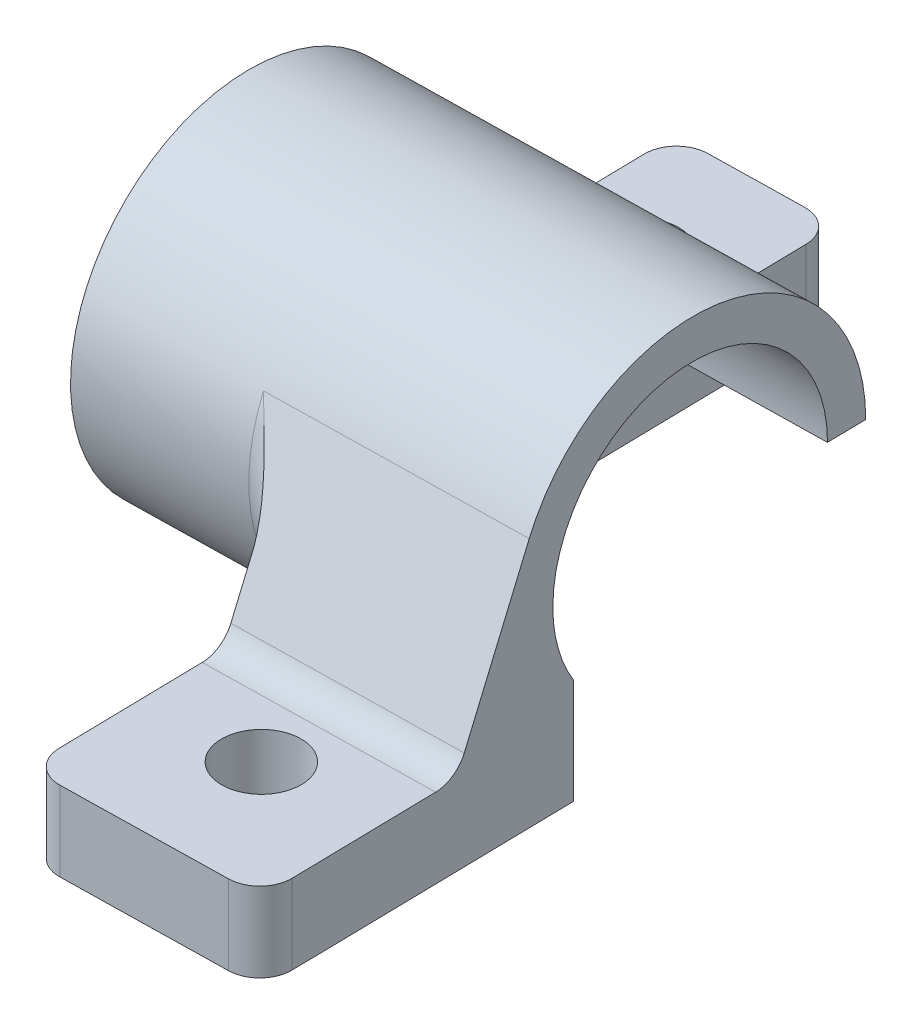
ISO-10303-21;
HEADER;
FILE_DESCRIPTION(('STEP AP214'),'2;1');
FILE_NAME('part.step','',(''),(''),'','','');
FILE_SCHEMA(('AUTOMOTIVE_DESIGN { 1 0 10303 214 1 1 1 1 }'));
ENDSEC;
DATA;
#1=APPLICATION_CONTEXT('core data for automotive mechanical design processes');
#2=APPLICATION_PROTOCOL_DEFINITION('international standard','automotive_design',2000,#1);
#3=PRODUCT_CONTEXT('',#1,'mechanical');
#4=PRODUCT('Part','Part','',(#3));
#5=PRODUCT_RELATED_PRODUCT_CATEGORY('part','',(#4));
#6=PRODUCT_DEFINITION_FORMATION('','',#4);
#7=PRODUCT_DEFINITION_CONTEXT('part definition',#1,'design');
#8=PRODUCT_DEFINITION('design','',#6,#7);
#9=PRODUCT_DEFINITION_SHAPE('','',#8);
#10=(LENGTH_UNIT() NAMED_UNIT(*) SI_UNIT(.MILLI.,.METRE.));
#11=(NAMED_UNIT(*) PLANE_ANGLE_UNIT() SI_UNIT($,.RADIAN.));
#12=(NAMED_UNIT(*) SI_UNIT($,.STERADIAN.) SOLID_ANGLE_UNIT());
#13=UNCERTAINTY_MEASURE_WITH_UNIT(LENGTH_MEASURE(1.E-05),#10,'distance_accuracy_value','');
#14=(GEOMETRIC_REPRESENTATION_CONTEXT(3) GLOBAL_UNCERTAINTY_ASSIGNED_CONTEXT((#13)) GLOBAL_UNIT_ASSIGNED_CONTEXT((#10,
#11,#12)) REPRESENTATION_CONTEXT('',''));
#15=CARTESIAN_POINT('',(0.,0.,0.));
#16=DIRECTION('',(0.,0.,1.));
#17=DIRECTION('',(1.,0.,0.));
#18=AXIS2_PLACEMENT_3D('',#15,#16,#17);
#19=CARTESIAN_POINT('',(-1070.44645277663,462.23498347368,1305.79350366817));
#20=DIRECTION('',(-0.999820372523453,0.,0.0189531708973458));
#21=DIRECTION('',(0.0189531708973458,0.,0.999820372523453));
#22=AXIS2_PLACEMENT_3D('',#19,#20,#21);
#23=CYLINDRICAL_SURFACE('',#22,14.2874999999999);
#24=CARTESIAN_POINT('',(-1128.24422138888,451.584179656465,1297.36415146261));
#25=CARTESIAN_POINT('',(-1128.47376178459,451.588078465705,1297.36414621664));
#26=CARTESIAN_POINT('',(-1128.70338365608,451.584520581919,1297.37246113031));
#27=CARTESIAN_POINT('',(-1129.1608115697,451.562708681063,1297.4055837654));
#28=CARTESIAN_POINT('',(-1129.3886170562,451.544450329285,1297.43039635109));
#29=CARTESIAN_POINT('',(-1129.84063126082,451.494070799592,1297.49610334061));
#30=CARTESIAN_POINT('',(-1130.06483462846,451.461930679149,1297.53701971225));
#31=CARTESIAN_POINT('',(-1130.50779061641,451.385203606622,1297.6342427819));
#32=CARTESIAN_POINT('',(-1130.72654041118,451.340610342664,1297.69055728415));
#33=CARTESIAN_POINT('',(-1131.15509750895,451.241240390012,1297.81711480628));
#34=CARTESIAN_POINT('',(-1131.36497204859,451.18656923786,1297.88721393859));
#35=CARTESIAN_POINT('',(-1131.77725522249,451.068579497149,1298.0408886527));
#36=CARTESIAN_POINT('',(-1131.97966033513,451.005256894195,1298.12447049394));
#37=CARTESIAN_POINT('',(-1132.5746656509,450.805086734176,1298.39430504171));
#38=CARTESIAN_POINT('',(-1132.9553667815,450.657959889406,1298.59974016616));
#39=CARTESIAN_POINT('',(-1133.5262352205,450.415707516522,1298.95905114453));
#40=CARTESIAN_POINT('',(-1133.72842009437,450.325163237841,1299.09755278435));
#41=CARTESIAN_POINT('',(-1134.12092978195,450.141640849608,1299.38917435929));
#42=CARTESIAN_POINT('',(-1134.31125283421,450.04866238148,1299.54229645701));
#43=CARTESIAN_POINT('',(-1134.67965419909,449.86224913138,1299.86273656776));
#44=CARTESIAN_POINT('',(-1134.85772039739,449.768813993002,1300.03006827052));
#45=CARTESIAN_POINT('',(-1135.20085838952,449.583457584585,1300.37834652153));
#46=CARTESIAN_POINT('',(-1135.36593005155,449.491536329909,1300.55929320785));
#47=CARTESIAN_POINT('',(-1135.70884457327,449.295899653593,1300.96572022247));
#48=CARTESIAN_POINT('',(-1135.8842111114,449.192780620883,1301.19358920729));
#49=CARTESIAN_POINT('',(-1136.21494174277,448.993769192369,1301.66646152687));
#50=CARTESIAN_POINT('',(-1136.37030240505,448.897878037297,1301.91146778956));
#51=CARTESIAN_POINT('',(-1136.65917228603,448.716108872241,1302.41713866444));
#52=CARTESIAN_POINT('',(-1136.79270929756,448.630218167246,1302.67778277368));
#53=CARTESIAN_POINT('',(-1137.03632250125,448.470878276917,1303.21341216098));
#54=CARTESIAN_POINT('',(-1137.14640727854,448.397424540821,1303.48839214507));
#55=CARTESIAN_POINT('',(-1137.31777365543,448.281244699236,1303.98273497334));
#56=CARTESIAN_POINT('',(-1137.38442218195,448.235380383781,1304.1995159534));
#57=CARTESIAN_POINT('',(-1137.50240175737,448.153076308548,1304.63894176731));
#58=CARTESIAN_POINT('',(-1137.55373581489,448.116634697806,1304.86158544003));
#59=CARTESIAN_POINT('',(-1137.64040247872,448.053966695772,1305.3112417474));
#60=CARTESIAN_POINT('',(-1137.6757451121,448.027733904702,1305.53825155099));
#61=CARTESIAN_POINT('',(-1137.72997160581,447.986035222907,1305.99522472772));
#62=CARTESIAN_POINT('',(-1137.74885499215,447.970569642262,1306.22518818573));
#63=CARTESIAN_POINT('',(-1137.76988272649,447.950743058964,1306.68687301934));
#64=CARTESIAN_POINT('',(-1137.77198986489,447.946406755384,1306.91859716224));
#65=CARTESIAN_POINT('',(-1137.75930491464,447.949012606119,1307.38151764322));
#66=CARTESIAN_POINT('',(-1137.74451286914,447.955954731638,1307.61271398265));
#67=CARTESIAN_POINT('',(-1137.69821218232,447.980956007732,1308.07286016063));
#68=CARTESIAN_POINT('',(-1137.66670021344,447.999017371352,1308.30180954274));
#69=CARTESIAN_POINT('',(-1137.58737628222,448.045842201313,1308.75574499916));
#70=CARTESIAN_POINT('',(-1137.5395643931,448.074605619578,1308.98073109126));
#71=CARTESIAN_POINT('',(-1137.42988841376,448.141201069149,1309.41869864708));
#72=CARTESIAN_POINT('',(-1137.36847805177,448.178742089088,1309.63183863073));
#73=CARTESIAN_POINT('',(-1137.23153710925,448.262570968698,1310.05183861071));
#74=CARTESIAN_POINT('',(-1137.15600158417,448.308861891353,1310.25869637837));
#75=CARTESIAN_POINT('',(-1136.99160258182,448.409300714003,1310.66499100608));
#76=CARTESIAN_POINT('',(-1136.90274277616,448.463446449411,1310.86442989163));
#77=CARTESIAN_POINT('',(-1136.71242675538,448.578672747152,1311.2551997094));
#78=CARTESIAN_POINT('',(-1136.61096596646,448.639755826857,1311.44652766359));
#79=CARTESIAN_POINT('',(-1136.38538075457,448.774309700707,1311.83925029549));
#80=CARTESIAN_POINT('',(-1136.2600022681,448.848408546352,1312.03970947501));
#81=CARTESIAN_POINT('',(-1135.99582650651,449.002413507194,1312.42933892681));
#82=CARTESIAN_POINT('',(-1135.85702345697,449.0823221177,1312.61850428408));
#83=CARTESIAN_POINT('',(-1135.56679007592,449.246544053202,1312.98507666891));
#84=CARTESIAN_POINT('',(-1135.41535122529,449.330860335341,1313.16247561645));
#85=CARTESIAN_POINT('',(-1135.10065017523,449.502377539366,1313.50497387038));
#86=CARTESIAN_POINT('',(-1134.93738684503,449.589578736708,1313.67007199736));
#87=CARTESIAN_POINT('',(-1134.57184156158,449.779808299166,1314.0137369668));
#88=CARTESIAN_POINT('',(-1134.36756012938,449.883079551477,1314.19004865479));
#89=CARTESIAN_POINT('',(-1133.94453578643,450.088926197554,1314.52491140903));
#90=CARTESIAN_POINT('',(-1133.72579028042,450.191501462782,1314.68345927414));
#91=CARTESIAN_POINT('',(-1133.27451973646,450.393159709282,1314.98204438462));
#92=CARTESIAN_POINT('',(-1133.04199654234,450.492243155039,1315.12208409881));
#93=CARTESIAN_POINT('',(-1132.5637662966,450.683861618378,1315.38275388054));
#94=CARTESIAN_POINT('',(-1132.31806266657,450.776398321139,1315.50338895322));
#95=CARTESIAN_POINT('',(-1131.86627826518,450.933445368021,1315.70129864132));
#96=CARTESIAN_POINT('',(-1131.66250100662,450.999795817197,1315.78238217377));
#97=CARTESIAN_POINT('',(-1131.24765706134,451.124426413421,1315.93091650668));
#98=CARTESIAN_POINT('',(-1131.03659211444,451.182708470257,1315.99837053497));
#99=CARTESIAN_POINT('',(-1130.60815489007,451.289288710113,1316.11882621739));
#100=CARTESIAN_POINT('',(-1130.39078993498,451.33759799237,1316.17184395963));
#101=CARTESIAN_POINT('',(-1129.95075881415,451.422494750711,1316.26271996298));
#102=CARTESIAN_POINT('',(-1129.72809556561,451.45908852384,1316.30058637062));
#103=CARTESIAN_POINT('',(-1129.27680762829,451.519311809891,1316.36077592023));
#104=CARTESIAN_POINT('',(-1129.04814706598,451.542819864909,1316.38295394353));
#105=CARTESIAN_POINT('',(-1128.58877811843,451.575233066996,1316.41069773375));
#106=CARTESIAN_POINT('',(-1128.35806977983,451.584138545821,1316.41626387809));
#107=CARTESIAN_POINT('',(-1127.89680756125,451.586899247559,1316.41060716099));
#108=CARTESIAN_POINT('',(-1127.66625366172,451.580757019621,1316.39938714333));
#109=CARTESIAN_POINT('',(-1127.20744491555,451.553737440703,1316.36035674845));
#110=CARTESIAN_POINT('',(-1126.97918998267,451.532860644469,1316.33254699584));
#111=CARTESIAN_POINT('',(-1126.55494127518,451.480819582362,1316.26530275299));
#112=CARTESIAN_POINT('',(-1126.35845065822,451.451248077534,1316.22773267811));
#113=CARTESIAN_POINT('',(-1125.96979039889,451.3825865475,1316.14076179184));
#114=CARTESIAN_POINT('',(-1125.77762201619,451.343493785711,1316.09135757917));
#115=CARTESIAN_POINT('',(-1125.20872008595,451.213640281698,1315.92613942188));
#116=CARTESIAN_POINT('',(-1124.83960530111,451.110306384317,1315.79332247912));
#117=CARTESIAN_POINT('',(-1124.23047416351,450.913986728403,1315.5315718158));
#118=CARTESIAN_POINT('',(-1123.98408494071,450.826703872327,1315.41270175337));
#119=CARTESIAN_POINT('',(-1123.50468292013,450.643967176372,1315.1557277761));
#120=CARTESIAN_POINT('',(-1123.27167041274,450.548513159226,1315.01762344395));
#121=CARTESIAN_POINT('',(-1122.81932865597,450.352457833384,1314.72299963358));
#122=CARTESIAN_POINT('',(-1122.60002271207,450.251848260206,1314.56645002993));
#123=CARTESIAN_POINT('',(-1122.17605611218,450.048503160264,1314.23593458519));
#124=CARTESIAN_POINT('',(-1121.97139398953,449.945767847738,1314.06197049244));
#125=CARTESIAN_POINT('',(-1121.57467670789,449.739394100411,1313.69479866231));
#126=CARTESIAN_POINT('',(-1121.38282942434,449.635762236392,1313.50136253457));
#127=CARTESIAN_POINT('',(-1121.01566966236,449.431528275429,1313.09786027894));
#128=CARTESIAN_POINT('',(-1120.84035829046,449.330926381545,1312.88779303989));
#129=CARTESIAN_POINT('',(-1120.50758323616,449.135302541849,1312.4519856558));
#130=CARTESIAN_POINT('',(-1120.35009743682,449.04027375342,1312.22626550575));
#131=CARTESIAN_POINT('',(-1120.05405052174,448.858004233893,1311.75977762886));
#132=CARTESIAN_POINT('',(-1119.91548578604,448.770762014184,1311.51901279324));
#133=CARTESIAN_POINT('',(-1119.67957954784,448.619649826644,1311.06374018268));
#134=CARTESIAN_POINT('',(-1119.5791966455,448.554283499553,1310.85130120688));
#135=CARTESIAN_POINT('',(-1119.39370662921,448.431874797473,1310.41755416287));
#136=CARTESIAN_POINT('',(-1119.30859684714,448.374830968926,1310.19624765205));
#137=CARTESIAN_POINT('',(-1119.15461836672,448.270272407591,1309.74595592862));
#138=CARTESIAN_POINT('',(-1119.08574297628,448.222753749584,1309.5169739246));
#139=CARTESIAN_POINT('',(-1118.96507557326,448.13827878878,1309.05262452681));
#140=CARTESIAN_POINT('',(-1118.91328374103,448.101322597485,1308.81725706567));
#141=CARTESIAN_POINT('',(-1118.82733061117,448.038700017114,1308.34060658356));
#142=CARTESIAN_POINT('',(-1118.79325779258,448.013090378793,1308.09930005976));
#143=CARTESIAN_POINT('',(-1118.74369237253,447.974077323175,1307.61379684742));
#144=CARTESIAN_POINT('',(-1118.72819982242,447.960673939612,1307.36960015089));
#145=CARTESIAN_POINT('',(-1118.71608410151,447.94642476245,1306.88041620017));
#146=CARTESIAN_POINT('',(-1118.71945743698,447.945576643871,1306.63542910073));
#147=CARTESIAN_POINT('',(-1118.74504770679,447.956455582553,1306.14673282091));
#148=CARTESIAN_POINT('',(-1118.76726356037,447.968181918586,1305.90302356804));
#149=CARTESIAN_POINT('',(-1118.82760585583,448.002421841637,1305.43893199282));
#150=CARTESIAN_POINT('',(-1118.86426739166,448.023964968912,1305.21828487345));
#151=CARTESIAN_POINT('',(-1118.95271227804,448.076906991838,1304.78126622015));
#152=CARTESIAN_POINT('',(-1119.00449463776,448.108305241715,1304.56489440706));
#153=CARTESIAN_POINT('',(-1119.12257198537,448.180311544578,1304.13774445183));
#154=CARTESIAN_POINT('',(-1119.18886613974,448.220919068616,1303.9269659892));
#155=CARTESIAN_POINT('',(-1119.33528475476,448.310571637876,1303.51203751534));
#156=CARTESIAN_POINT('',(-1119.41541454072,448.359619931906,1303.30789009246));
#157=CARTESIAN_POINT('',(-1119.59277257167,448.467716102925,1302.89787917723));
#158=CARTESIAN_POINT('',(-1119.69062463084,448.527124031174,1302.69238089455));
#159=CARTESIAN_POINT('',(-1119.89976999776,448.653098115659,1302.2905557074));
#160=CARTESIAN_POINT('',(-1120.01106787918,448.719666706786,1302.09423195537));
#161=CARTESIAN_POINT('',(-1120.24621930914,448.858772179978,1301.71150418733));
#162=CARTESIAN_POINT('',(-1120.37007204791,448.931308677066,1301.52509953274));
#163=CARTESIAN_POINT('',(-1120.62956478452,449.081153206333,1301.16269436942));
#164=CARTESIAN_POINT('',(-1120.7652061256,449.158461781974,1300.98669505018));
#165=CARTESIAN_POINT('',(-1121.06920598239,449.328727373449,1300.61938395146));
#166=CARTESIAN_POINT('',(-1121.23939390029,449.422267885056,1300.42985413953));
#167=CARTESIAN_POINT('',(-1121.59356865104,449.61207557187,1300.06573973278));
#168=CARTESIAN_POINT('',(-1121.77755311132,449.708342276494,1299.89115257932));
#169=CARTESIAN_POINT('',(-1122.15908433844,449.901815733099,1299.55694855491));
#170=CARTESIAN_POINT('',(-1122.3566624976,449.999024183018,1299.39736849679));
#171=CARTESIAN_POINT('',(-1122.76432426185,450.191928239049,1299.09422635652));
#172=CARTESIAN_POINT('',(-1122.97440376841,450.287624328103,1298.95065906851));
#173=CARTESIAN_POINT('',(-1123.43386242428,450.486978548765,1298.66306623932));
#174=CARTESIAN_POINT('',(-1123.68486019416,450.590123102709,1298.52125675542));
#175=CARTESIAN_POINT('',(-1124.2015167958,450.787805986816,1298.25978273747));
#176=CARTESIAN_POINT('',(-1124.46717981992,450.882341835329,1298.14012457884));
#177=CARTESIAN_POINT('',(-1125.01110097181,451.058274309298,1297.92490280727));
#178=CARTESIAN_POINT('',(-1125.28930831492,451.139718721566,1297.82925081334));
#179=CARTESIAN_POINT('',(-1125.85736083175,451.285419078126,1297.66332120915));
#180=CARTESIAN_POINT('',(-1126.14719506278,451.349690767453,1297.59302033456));
#181=CARTESIAN_POINT('',(-1126.73557104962,451.456798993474,1297.47962579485));
#182=CARTESIAN_POINT('',(-1127.03409699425,451.499672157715,1297.43648560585));
#183=CARTESIAN_POINT('',(-1127.63644227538,451.56077826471,1297.37875514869));
#184=CARTESIAN_POINT('',(-1127.94026039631,451.579016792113,1297.36415840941));
#185=CARTESIAN_POINT('',(-1128.24422138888,451.584179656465,1297.36415146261));
#186=B_SPLINE_CURVE_WITH_KNOTS('',3,(#24,#25,#26,#27,#28,#29,#30,#31,#32,#33,#34,#35,#36,#37,
#38,#39,#40,#41,#42,#43,#44,#45,#46,#47,#48,#49,#50,#51,#52,#53,#54,#55,#56,#57,#58,#59,#60,#61,
#62,#63,#64,#65,#66,#67,#68,#69,#70,#71,#72,#73,#74,#75,#76,#77,#78,#79,#80,#81,#82,#83,#84,#85,
#86,#87,#88,#89,#90,#91,#92,#93,#94,#95,#96,#97,#98,#99,#100,#101,#102,#103,#104,#105,#106,#107,
#108,#109,#110,#111,#112,#113,#114,#115,#116,#117,#118,#119,#120,#121,#122,#123,#124,#125,#126,
#127,#128,#129,#130,#131,#132,#133,#134,#135,#136,#137,#138,#139,#140,#141,#142,#143,#144,#145,
#146,#147,#148,#149,#150,#151,#152,#153,#154,#155,#156,#157,#158,#159,#160,#161,#162,#163,#164,
#165,#166,#167,#168,#169,#170,#171,#172,#173,#174,#175,#176,#177,#178,#179,#180,#181,#182,#183,
#184,#185),.UNSPECIFIED.,.T.,.F.,(4,2,2,2,2,2,2,2,2,2,2,2,2,2,2,2,2,2,2,2,2,2,2,2,2,2,2,2,2,2,2,
2,2,2,2,2,2,2,2,2,2,2,2,2,2,2,2,2,2,2,2,2,2,2,2,2,2,2,2,2,2,2,2,2,2,2,2,2,2,2,2,2,2,2,2,2,2,2,2,
2,4),(0.,0.688372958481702,1.37694897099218,2.0664675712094,2.75633629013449,3.43935348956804,
4.12268870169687,5.48836770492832,6.27163837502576,7.05502508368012,7.8391752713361,
8.62333341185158,9.53854638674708,10.4539161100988,11.3681108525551,12.28197035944,
12.9754177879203,13.6687288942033,14.361604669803,15.054500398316,15.748932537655,
16.44336290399,17.1379315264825,17.8324970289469,18.5066725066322,19.1810844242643,
19.8553108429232,20.5297827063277,21.2723880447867,22.015314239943,22.7587454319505,
23.5022478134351,24.3681138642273,25.23413569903,26.1000418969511,26.9657243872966,
27.6525276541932,28.3391680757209,29.0250401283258,29.7105429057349,30.4023065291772,
31.0940544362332,31.785685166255,32.4772898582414,33.0833094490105,33.6895034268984,
34.9019385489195,35.7624380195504,36.6229561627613,37.4848997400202,38.3467568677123,
39.2202672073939,40.0938359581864,40.9663086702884,41.8386142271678,42.5695420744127,
43.3003421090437,44.0308403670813,44.761346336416,45.495465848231,46.2295873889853,
46.9635729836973,47.6975164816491,48.3708693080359,49.0441780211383,49.7174480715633,
50.3909778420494,51.09596638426,51.8011954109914,52.5063789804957,53.211643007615,
54.0249003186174,54.8380180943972,55.6530811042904,56.467878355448,57.3852150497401,
58.3028153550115,59.2169861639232,60.1303159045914,61.0420769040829,61.9536311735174),.UNSPECIFIED.);
#187=CARTESIAN_POINT('',(-1137.76751043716,447.94748347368,1307.06968041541));
#188=VERTEX_POINT('',#187);
#189=CARTESIAN_POINT('',(-1131.50619481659,451.046650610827,1315.8381823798));
#190=VERTEX_POINT('',#189);
#191=EDGE_CURVE('E229',#188,#190,#186,.T.);
#192=ORIENTED_EDGE('',*,*,#191,.T.);
#193=CARTESIAN_POINT('',(-1131.67460508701,462.23498347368,1306.95417979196));
#194=DIRECTION('',(0.999820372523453,0.,-0.0189531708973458));
#195=DIRECTION('',(-0.0189531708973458,0.,-0.999820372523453));
#196=AXIS2_PLACEMENT_3D('',#193,#194,#195);
#197=CIRCLE('',#196,14.2874999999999);
#198=CARTESIAN_POINT('',(-1131.42639782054,467.947445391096,1320.04764488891));
#199=VERTEX_POINT('',#198);
#200=EDGE_CURVE('E209',#190,#199,#197,.F.);
#201=ORIENTED_EDGE('',*,*,#200,.T.);
#202=DIRECTION('',(0.999820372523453,0.,-0.0189531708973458));
#203=VECTOR('',#202,1.);
#204=CARTESIAN_POINT('',(-1161.24277596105,467.947445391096,1320.61286132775));
#205=LINE('',#204,#203);
#206=CARTESIAN_POINT('',(-1110.60213910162,467.947445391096,1319.65288824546));
#207=VERTEX_POINT('',#206);
#208=EDGE_CURVE('E198',#199,#207,#205,.T.);
#209=ORIENTED_EDGE('',*,*,#208,.T.);
#210=CARTESIAN_POINT('',(-1110.85034636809,462.23498347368,1306.55942314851));
#211=DIRECTION('',(0.999820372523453,0.,-0.0189531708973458));
#212=DIRECTION('',(-0.0189531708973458,0.,-0.999820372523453));
#213=AXIS2_PLACEMENT_3D('',#210,#211,#212);
#214=CIRCLE('',#213,14.2874999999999);
#215=CARTESIAN_POINT('',(-1111.12113979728,462.23498347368,1292.27448957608));
#216=VERTEX_POINT('',#215);
#217=EDGE_CURVE('E210',#207,#216,#214,.F.);
#218=ORIENTED_EDGE('',*,*,#217,.T.);
#219=DIRECTION('',(0.999820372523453,0.,-0.0189531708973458));
#220=VECTOR('',#219,1.);
#221=CARTESIAN_POINT('',(-1129.40585476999,462.23498347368,1292.62110516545));
#222=LINE('',#221,#220);
#223=CARTESIAN_POINT('',(-1129.40585476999,462.23498347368,1292.62110516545));
#224=VERTEX_POINT('',#223);
#225=EDGE_CURVE('E587',#224,#216,#222,.T.);
#226=ORIENTED_EDGE('',*,*,#225,.F.);
#227=CARTESIAN_POINT('',(-1129.1350613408,462.23498347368,1306.90603873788));
#228=DIRECTION('',(0.999820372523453,0.,-0.0189531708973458));
#229=DIRECTION('',(-0.0189531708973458,0.,-0.999820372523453));
#230=AXIS2_PLACEMENT_3D('',#227,#228,#229);
#231=CIRCLE('',#230,14.2875);
#232=CARTESIAN_POINT('',(-1129.31479871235,451.548500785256,1297.42450729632));
#233=VERTEX_POINT('',#232);
#234=EDGE_CURVE('E584',#233,#224,#231,.T.);
#235=ORIENTED_EDGE('',*,*,#234,.F.);
#236=CARTESIAN_POINT('',(-1130.57667296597,451.36945632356,1297.65414769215));
#237=VERTEX_POINT('',#236);
#238=EDGE_CURVE('E222',#233,#237,#186,.T.);
#239=ORIENTED_EDGE('',*,*,#238,.T.);
#240=CARTESIAN_POINT('',(-1130.40083393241,462.23498347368,1306.93003345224));
#241=DIRECTION('',(0.999820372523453,0.,-0.0189531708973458));
#242=DIRECTION('',(-0.0189531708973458,0.,-0.999820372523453));
#243=AXIS2_PLACEMENT_3D('',#240,#241,#242);
#244=CIRCLE('',#243,14.2874999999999);
#245=CARTESIAN_POINT('',(-1130.64904119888,467.947445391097,1293.83656835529));
#246=VERTEX_POINT('',#245);
#247=EDGE_CURVE('E644',#237,#246,#244,.T.);
#248=ORIENTED_EDGE('',*,*,#247,.T.);
#249=DIRECTION('',(-0.999820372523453,0.,0.0189531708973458));
#250=VECTOR('',#249,1.);
#251=CARTESIAN_POINT('',(-1133.18858494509,467.947445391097,1293.88470940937));
#252=LINE('',#251,#250);
#253=CARTESIAN_POINT('',(-1145.88630367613,467.947445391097,1294.12541467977));
#254=VERTEX_POINT('',#253);
#255=EDGE_CURVE('E583',#246,#254,#252,.T.);
#256=ORIENTED_EDGE('',*,*,#255,.T.);
#257=CARTESIAN_POINT('',(-1145.63809640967,462.23498347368,1307.21887977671));
#258=DIRECTION('',(-0.999820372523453,0.,0.0189531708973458));
#259=DIRECTION('',(0.0189531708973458,0.,0.999820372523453));
#260=AXIS2_PLACEMENT_3D('',#257,#258,#259);
#261=CIRCLE('',#260,14.2874999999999);
#262=CARTESIAN_POINT('',(-1145.63809640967,447.94748347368,1307.21887977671));
#263=VERTEX_POINT('',#262);
#264=EDGE_CURVE('E221',#263,#254,#261,.T.);
#265=ORIENTED_EDGE('',*,*,#264,.F.);
#266=DIRECTION('',(-0.999820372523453,0.,0.0189531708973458));
#267=VECTOR('',#266,1.);
#268=CARTESIAN_POINT('',(-1132.94037767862,447.94748347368,1306.97817450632));
#269=LINE('',#268,#267);
#270=EDGE_CURVE('E566',#188,#263,#269,.T.);
#271=ORIENTED_EDGE('',*,*,#270,.F.);
#272=EDGE_LOOP('',(#192,#201,#209,#218,#226,#235,#239,#248,#256,#265,#271));
#273=FACE_BOUND('',#272,.T.);
#274=ADVANCED_FACE('F39',(#273),#23,.T.);
#275=CARTESIAN_POINT('',(-1128.24422138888,462.534,1306.88915146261));
#276=DIRECTION('',(0.,-1.,0.));
#277=DIRECTION('',(0.,0.,-1.));
#278=AXIS2_PLACEMENT_3D('',#275,#276,#277);
#279=CYLINDRICAL_SURFACE('',#278,9.52500000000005);
#280=CARTESIAN_POINT('',(-1128.24422138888,456.386056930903,1297.36415146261));
#281=CARTESIAN_POINT('',(-1128.40072049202,456.390882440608,1297.36415285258));
#282=CARTESIAN_POINT('',(-1128.55744605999,456.389420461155,1297.36801905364));
#283=CARTESIAN_POINT('',(-1128.86995510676,456.37398057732,1297.38343817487));
#284=CARTESIAN_POINT('',(-1129.02573804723,456.359996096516,1297.39499513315));
#285=CARTESIAN_POINT('',(-1129.33535375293,456.320204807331,1297.42557359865));
#286=CARTESIAN_POINT('',(-1129.48918186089,456.294373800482,1297.44461037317));
#287=CARTESIAN_POINT('',(-1129.79363638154,456.232100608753,1297.48975544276));
#288=CARTESIAN_POINT('',(-1129.94426157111,456.195654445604,1297.51586638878));
#289=CARTESIAN_POINT('',(-1130.29683889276,456.098395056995,1297.58562689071));
#290=CARTESIAN_POINT('',(-1130.49710499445,456.033557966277,1297.63218945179));
#291=CARTESIAN_POINT('',(-1130.88973991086,455.890524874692,1297.73665512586));
#292=CARTESIAN_POINT('',(-1131.08210464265,455.812322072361,1297.79456401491));
#293=CARTESIAN_POINT('',(-1131.45946330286,455.645727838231,1297.9210099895));
#294=CARTESIAN_POINT('',(-1131.64443312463,455.557306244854,1297.98957875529));
#295=CARTESIAN_POINT('',(-1132.00665921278,455.373289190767,1298.13655854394));
#296=CARTESIAN_POINT('',(-1132.18391576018,455.277693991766,1298.21496920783));
#297=CARTESIAN_POINT('',(-1132.6311612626,455.025109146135,1298.4290986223));
#298=CARTESIAN_POINT('',(-1132.89576086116,454.864469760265,1298.57181390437));
#299=CARTESIAN_POINT('',(-1133.408025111,454.537716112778,1298.87977661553));
#300=CARTESIAN_POINT('',(-1133.65568047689,454.371598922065,1299.04503625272));
#301=CARTESIAN_POINT('',(-1134.13422152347,454.039026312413,1299.39770279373));
#302=CARTESIAN_POINT('',(-1134.36511483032,453.872571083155,1299.58509952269));
#303=CARTESIAN_POINT('',(-1134.80978034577,453.543441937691,1299.9820660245));
#304=CARTESIAN_POINT('',(-1135.02355893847,453.380766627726,1300.19162746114));
#305=CARTESIAN_POINT('',(-1135.39653863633,453.091132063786,1300.59381735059));
#306=CARTESIAN_POINT('',(-1135.55868955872,452.962960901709,1300.7828426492));
#307=CARTESIAN_POINT('',(-1135.86969550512,452.713685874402,1301.17595840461));
#308=CARTESIAN_POINT('',(-1136.01855052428,452.592582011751,1301.38004886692));
#309=CARTESIAN_POINT('',(-1136.30144467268,452.359691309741,1301.80276217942));
#310=CARTESIAN_POINT('',(-1136.43550586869,452.247890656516,1302.02136258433));
#311=CARTESIAN_POINT('',(-1136.68749438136,452.035536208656,1302.47286808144));
#312=CARTESIAN_POINT('',(-1136.80542530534,451.934979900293,1302.70576995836));
#313=CARTESIAN_POINT('',(-1137.00194098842,451.765754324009,1303.13779496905));
#314=CARTESIAN_POINT('',(-1137.0837016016,451.694704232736,1303.33454559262));
#315=CARTESIAN_POINT('',(-1137.23471455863,451.56237654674,1303.73595969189));
#316=CARTESIAN_POINT('',(-1137.30396952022,451.501096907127,1303.94062150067));
#317=CARTESIAN_POINT('',(-1137.42900528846,451.389393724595,1304.35684654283));
#318=CARTESIAN_POINT('',(-1137.48479069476,451.338966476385,1304.56840739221));
#319=CARTESIAN_POINT('',(-1137.58203109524,451.249917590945,1304.99725582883));
#320=CARTESIAN_POINT('',(-1137.62348591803,451.21129609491,1305.21454348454));
#321=CARTESIAN_POINT('',(-1137.69150822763,451.146493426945,1305.65455593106));
#322=CARTESIAN_POINT('',(-1137.71799106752,451.120383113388,1305.87730435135));
#323=CARTESIAN_POINT('',(-1137.75517235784,451.081519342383,1306.32528225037));
#324=CARTESIAN_POINT('',(-1137.76587077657,451.06876591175,1306.55051173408));
#325=CARTESIAN_POINT('',(-1137.77122767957,451.05691812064,1307.00147978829));
#326=CARTESIAN_POINT('',(-1137.76588917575,451.057821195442,1307.22721825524));
#327=CARTESIAN_POINT('',(-1137.73923595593,451.073259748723,1307.67726949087));
#328=CARTESIAN_POINT('',(-1137.71792217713,451.087794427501,1307.90158234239));
#329=CARTESIAN_POINT('',(-1137.66229500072,451.128254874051,1308.32697749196));
#330=CARTESIAN_POINT('',(-1137.62931310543,451.153046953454,1308.52834482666));
#331=CARTESIAN_POINT('',(-1137.5508700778,451.213191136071,1308.92709565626));
#332=CARTESIAN_POINT('',(-1137.50540474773,451.248546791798,1309.12447778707));
#333=CARTESIAN_POINT('',(-1137.40263040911,451.329178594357,1309.5139811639));
#334=CARTESIAN_POINT('',(-1137.34532499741,451.374451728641,1309.70610398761));
#335=CARTESIAN_POINT('',(-1137.21955219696,451.474199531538,1310.08427169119));
#336=CARTESIAN_POINT('',(-1137.15108061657,451.528677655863,1310.27031425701));
#337=CARTESIAN_POINT('',(-1136.99928606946,451.649563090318,1310.64655186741));
#338=CARTESIAN_POINT('',(-1136.91531546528,451.716492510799,1310.83631786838));
#339=CARTESIAN_POINT('',(-1136.73658809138,451.858759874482,1311.20746230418));
#340=CARTESIAN_POINT('',(-1136.64182709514,451.934101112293,1311.38883741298));
#341=CARTESIAN_POINT('',(-1136.34263539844,452.171239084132,1311.9196775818));
#342=CARTESIAN_POINT('',(-1136.12325561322,452.3441825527,1312.25595592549));
#343=CARTESIAN_POINT('',(-1135.71100120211,452.664838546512,1312.81032211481));
#344=CARTESIAN_POINT('',(-1135.5254671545,452.807861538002,1313.03678479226));
#345=CARTESIAN_POINT('',(-1135.13754288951,453.102714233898,1313.46881724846));
#346=CARTESIAN_POINT('',(-1134.9351452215,453.254547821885,1313.67437770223));
#347=CARTESIAN_POINT('',(-1134.51447904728,453.564094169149,1314.06495222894));
#348=CARTESIAN_POINT('',(-1134.29617351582,453.721820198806,1314.24991566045));
#349=CARTESIAN_POINT('',(-1133.84492752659,454.03939996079,1314.598823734));
#350=CARTESIAN_POINT('',(-1133.6119908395,454.199253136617,1314.76277375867));
#351=CARTESIAN_POINT('',(-1133.16743190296,454.493521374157,1315.04675008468));
#352=CARTESIAN_POINT('',(-1132.95781508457,454.628173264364,1315.16968014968));
#353=CARTESIAN_POINT('',(-1132.52769890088,454.893397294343,1315.40014473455));
#354=CARTESIAN_POINT('',(-1132.30719723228,455.023968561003,1315.50767597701));
#355=CARTESIAN_POINT('',(-1131.85533277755,455.277010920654,1315.70653488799));
#356=CARTESIAN_POINT('',(-1131.62400020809,455.399502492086,1315.79790459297));
#357=CARTESIAN_POINT('',(-1131.14943600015,455.631858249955,1315.96376168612));
#358=CARTESIAN_POINT('',(-1130.90621337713,455.741731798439,1316.03826163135));
#359=CARTESIAN_POINT('',(-1130.36848810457,455.958145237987,1316.17901481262));
#360=CARTESIAN_POINT('',(-1130.07185285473,456.06157188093,1316.24223616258));
#361=CARTESIAN_POINT('',(-1129.61602355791,456.188542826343,1316.31610538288));
#362=CARTESIAN_POINT('',(-1129.46237947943,456.226155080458,1316.33722715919));
#363=CARTESIAN_POINT('',(-1129.1520366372,456.290501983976,1316.3720751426));
#364=CARTESIAN_POINT('',(-1128.99533953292,456.317242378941,1316.38580525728));
#365=CARTESIAN_POINT('',(-1128.67805777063,456.358796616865,1316.40560856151));
#366=CARTESIAN_POINT('',(-1128.51744918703,456.373472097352,1316.41159336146));
#367=CARTESIAN_POINT('',(-1128.19547105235,456.389566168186,1316.41538694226));
#368=CARTESIAN_POINT('',(-1128.03410155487,456.390985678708,1316.41319629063));
#369=CARTESIAN_POINT('',(-1127.71203172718,456.380482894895,1316.40063858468));
#370=CARTESIAN_POINT('',(-1127.55133182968,456.368553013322,1316.39026688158));
#371=CARTESIAN_POINT('',(-1127.23210273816,456.332018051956,1316.36158202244));
#372=CARTESIAN_POINT('',(-1127.07357388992,456.307410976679,1316.34326761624));
#373=CARTESIAN_POINT('',(-1126.73489141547,456.241959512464,1316.29559873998));
#374=CARTESIAN_POINT('',(-1126.55530037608,456.199157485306,1316.26495314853));
#375=CARTESIAN_POINT('',(-1126.20150892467,456.100646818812,1316.19428689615));
#376=CARTESIAN_POINT('',(-1126.02731291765,456.044927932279,1316.1542587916));
#377=CARTESIAN_POINT('',(-1125.68440222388,455.922961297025,1316.06544791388));
#378=CARTESIAN_POINT('',(-1125.51570456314,455.856684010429,1316.01664052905));
#379=CARTESIAN_POINT('',(-1125.18441551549,455.716040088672,1315.91098250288));
#380=CARTESIAN_POINT('',(-1125.02182275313,455.641675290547,1315.85413368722));
#381=CARTESIAN_POINT('',(-1124.59767018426,455.43598441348,1315.69303662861));
#382=CARTESIAN_POINT('',(-1124.34120337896,455.299309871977,1315.58216935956));
#383=CARTESIAN_POINT('',(-1123.84324062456,455.016123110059,1315.34099006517));
#384=CARTESIAN_POINT('',(-1123.60175424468,454.86960472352,1315.21066578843));
#385=CARTESIAN_POINT('',(-1123.13268285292,454.57162528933,1314.93106811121));
#386=CARTESIAN_POINT('',(-1122.90511719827,454.420157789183,1314.78176917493));
#387=CARTESIAN_POINT('',(-1122.46396823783,454.116432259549,1314.46464263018));
#388=CARTESIAN_POINT('',(-1122.25038181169,453.964174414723,1314.29681917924));
#389=CARTESIAN_POINT('',(-1121.8266374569,453.654250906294,1313.93344775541));
#390=CARTESIAN_POINT('',(-1121.6172283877,453.49671291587,1313.73691470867));
#391=CARTESIAN_POINT('',(-1121.2148590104,453.187654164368,1313.32319749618));
#392=CARTESIAN_POINT('',(-1121.02190169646,453.036134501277,1313.10600958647));
#393=CARTESIAN_POINT('',(-1120.65438493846,452.742731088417,1312.65154752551));
#394=CARTESIAN_POINT('',(-1120.47978418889,452.6008259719,1312.41432073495));
#395=CARTESIAN_POINT('',(-1120.15056345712,452.329587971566,1311.91970664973));
#396=CARTESIAN_POINT('',(-1119.99593447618,452.20024943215,1311.66232851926));
#397=CARTESIAN_POINT('',(-1119.75083078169,451.992785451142,1311.20588502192));
#398=CARTESIAN_POINT('',(-1119.65476835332,451.910697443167,1311.01159972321));
#399=CARTESIAN_POINT('',(-1119.47497409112,451.755779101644,1310.61386974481));
#400=CARTESIAN_POINT('',(-1119.39123907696,451.682946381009,1310.41042744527));
#401=CARTESIAN_POINT('',(-1119.23717320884,451.547780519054,1309.99522871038));
#402=CARTESIAN_POINT('',(-1119.16683697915,451.485443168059,1309.78347565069));
#403=CARTESIAN_POINT('',(-1119.04057333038,451.372404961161,1309.35265816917));
#404=CARTESIAN_POINT('',(-1118.9846462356,451.321704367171,1309.13359358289));
#405=CARTESIAN_POINT('',(-1118.88781902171,451.23268040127,1308.68796094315));
#406=CARTESIAN_POINT('',(-1118.8470300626,451.19444882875,1308.46135020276));
#407=CARTESIAN_POINT('',(-1118.7818556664,451.131747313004,1308.00388553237));
#408=CARTESIAN_POINT('',(-1118.75747022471,451.107277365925,1307.77303160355));
#409=CARTESIAN_POINT('',(-1118.72564879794,451.072705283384,1307.30917661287));
#410=CARTESIAN_POINT('',(-1118.71820589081,451.062597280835,1307.07617646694));
#411=CARTESIAN_POINT('',(-1118.72045919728,451.05698884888,1306.61009398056));
#412=CARTESIAN_POINT('',(-1118.73015384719,451.061487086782,1306.37701164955));
#413=CARTESIAN_POINT('',(-1118.76452167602,451.08367713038,1305.93843336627));
#414=CARTESIAN_POINT('',(-1118.78743292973,451.099865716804,1305.73271903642));
#415=CARTESIAN_POINT('',(-1118.84636861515,451.143396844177,1305.32437019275));
#416=CARTESIAN_POINT('',(-1118.88239334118,451.170739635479,1305.12173574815));
#417=CARTESIAN_POINT('',(-1118.96703706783,451.236064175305,1304.72086928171));
#418=CARTESIAN_POINT('',(-1119.01565640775,451.274046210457,1304.52263737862));
#419=CARTESIAN_POINT('',(-1119.12482917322,451.359974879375,1304.13170548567));
#420=CARTESIAN_POINT('',(-1119.18538322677,451.407922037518,1303.93900578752));
#421=CARTESIAN_POINT('',(-1119.3194076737,451.514370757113,1303.55512717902));
#422=CARTESIAN_POINT('',(-1119.39317358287,451.573114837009,1303.36411881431));
#423=CARTESIAN_POINT('',(-1119.55164099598,451.699350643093,1302.98965653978));
#424=CARTESIAN_POINT('',(-1119.63634648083,451.766845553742,1302.80620541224));
#425=CARTESIAN_POINT('',(-1119.90560333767,451.981034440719,1302.2681397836));
#426=CARTESIAN_POINT('',(-1120.10536917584,452.139491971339,1301.92560457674));
#427=CARTESIAN_POINT('',(-1120.48165019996,452.434881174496,1301.36186069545));
#428=CARTESIAN_POINT('',(-1120.65041149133,452.566475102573,1301.13247286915));
#429=CARTESIAN_POINT('',(-1121.00453764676,452.839549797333,1300.69300752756));
#430=CARTESIAN_POINT('',(-1121.18990924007,452.98103456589,1300.48293790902));
#431=CARTESIAN_POINT('',(-1121.57621177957,453.271396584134,1300.08172106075));
#432=CARTESIAN_POINT('',(-1121.77718871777,453.420295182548,1299.89063386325));
#433=CARTESIAN_POINT('',(-1122.19314204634,453.722151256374,1299.52802520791));
#434=CARTESIAN_POINT('',(-1122.40811618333,453.875108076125,1299.3565006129));
#435=CARTESIAN_POINT('',(-1122.85589440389,454.1849563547,1299.02977024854));
#436=CARTESIAN_POINT('',(-1123.0889634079,454.341866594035,1298.87494544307));
#437=CARTESIAN_POINT('',(-1123.56932017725,454.652903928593,1298.58556135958));
#438=CARTESIAN_POINT('',(-1123.81661402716,454.80702979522,1298.45101084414));
#439=CARTESIAN_POINT('',(-1124.3253500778,455.107172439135,1298.2030754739));
#440=CARTESIAN_POINT('',(-1124.58675311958,455.25320958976,1298.08963556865));
#441=CARTESIAN_POINT('',(-1125.12504219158,455.530912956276,1297.88474787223));
#442=CARTESIAN_POINT('',(-1125.40191099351,455.662594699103,1297.79327618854));
#443=CARTESIAN_POINT('',(-1125.99127842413,455.910583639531,1297.62906778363));
#444=CARTESIAN_POINT('',(-1126.3049232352,456.025336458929,1297.55793405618));
#445=CARTESIAN_POINT('',(-1126.78775874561,456.166541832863,1297.47475170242));
#446=CARTESIAN_POINT('',(-1126.95048189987,456.208411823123,1297.45096427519));
#447=CARTESIAN_POINT('',(-1127.27951378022,456.280079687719,1297.41168595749));
#448=CARTESIAN_POINT('',(-1127.4458198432,456.309886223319,1297.396189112));
#449=CARTESIAN_POINT('',(-1127.71774716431,456.347199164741,1297.37813579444));
#450=CARTESIAN_POINT('',(-1127.82263667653,456.358876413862,1297.37290387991));
#451=CARTESIAN_POINT('',(-1128.03305667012,456.37667809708,1297.36591039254));
#452=CARTESIAN_POINT('',(-1128.13858744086,456.382799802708,1297.36415052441));
#453=CARTESIAN_POINT('',(-1128.24422138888,456.386056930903,1297.36415146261));
#454=B_SPLINE_CURVE_WITH_KNOTS('',3,(#280,#281,#282,#283,#284,#285,#286,#287,#288,#289,#290,
#291,#292,#293,#294,#295,#296,#297,#298,#299,#300,#301,#302,#303,#304,#305,#306,#307,#308,#309,
#310,#311,#312,#313,#314,#315,#316,#317,#318,#319,#320,#321,#322,#323,#324,#325,#326,#327,#328,
#329,#330,#331,#332,#333,#334,#335,#336,#337,#338,#339,#340,#341,#342,#343,#344,#345,#346,#347,
#348,#349,#350,#351,#352,#353,#354,#355,#356,#357,#358,#359,#360,#361,#362,#363,#364,#365,#366,
#367,#368,#369,#370,#371,#372,#373,#374,#375,#376,#377,#378,#379,#380,#381,#382,#383,#384,#385,
#386,#387,#388,#389,#390,#391,#392,#393,#394,#395,#396,#397,#398,#399,#400,#401,#402,#403,#404,
#405,#406,#407,#408,#409,#410,#411,#412,#413,#414,#415,#416,#417,#418,#419,#420,#421,#422,#423,
#424,#425,#426,#427,#428,#429,#430,#431,#432,#433,#434,#435,#436,#437,#438,#439,#440,#441,#442,
#443,#444,#445,#446,#447,#448,#449,#450,#451,#452,#453),.UNSPECIFIED.,.T.,.F.,(4,2,2,2,2,2,2,2,
2,2,2,2,2,2,2,2,2,2,2,2,2,2,2,2,2,2,2,2,2,2,2,2,2,2,2,2,2,2,2,2,2,2,2,2,2,2,2,2,2,2,2,2,2,2,2,2,
2,2,2,2,2,2,2,2,2,2,2,2,2,2,2,2,2,2,2,2,2,2,2,2,2,2,2,2,2,2,4),(0.,0.469601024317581,
0.939448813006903,1.41026064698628,1.88124915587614,2.52694419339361,3.17296879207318,
3.82095137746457,4.46891033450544,5.49005734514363,6.51175953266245,7.5329939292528,
8.55384559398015,9.39338485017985,10.2329244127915,11.071194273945,11.9092763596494,
12.5824264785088,13.2554355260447,13.9282144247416,14.6010013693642,15.2775549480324,
15.9541098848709,16.6305377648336,17.3069259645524,17.9228857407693,18.5390528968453,
19.1550331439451,19.771245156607,20.4247147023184,21.0784410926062,22.3855631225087,
23.3619198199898,24.3387101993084,25.3178515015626,26.2967414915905,27.1295765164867,
27.9625885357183,28.7934009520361,29.6235929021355,30.5815026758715,31.0597859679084,
31.5378161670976,32.0212548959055,32.5046600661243,32.9883401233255,33.4720963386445,
34.0326546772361,34.5936592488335,35.1562617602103,35.7187367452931,36.6504207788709,
37.5826939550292,38.5162353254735,39.4495676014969,40.4311792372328,41.4129691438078,
42.3925003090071,43.3715885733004,44.0662546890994,44.7607412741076,45.4549486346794,
46.149171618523,46.8483959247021,47.5476200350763,48.2465584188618,48.9454330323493,
49.5675547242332,50.1896903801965,50.811842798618,51.4340279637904,52.0724298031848,
52.7110646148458,53.987653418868,54.9277016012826,55.8681323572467,56.8114484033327,
57.7546129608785,58.7160676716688,59.6779367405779,60.6372612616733,61.5955376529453,
62.6160629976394,63.1246215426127,63.6328143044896,63.9496306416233,64.2666024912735),.UNSPECIFIED.);
#455=CARTESIAN_POINT('',(-1129.31479871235,456.321335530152,1297.42450729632));
#456=VERTEX_POINT('',#455);
#457=CARTESIAN_POINT('',(-1128.95532396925,456.321335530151,1316.38757017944));
#458=VERTEX_POINT('',#457);
#459=EDGE_CURVE('E231',#456,#458,#454,.T.);
#460=ORIENTED_EDGE('',*,*,#459,.T.);
#461=DIRECTION('',(0.,-1.,0.));
#462=VECTOR('',#461,1.);
#463=CARTESIAN_POINT('',(-1128.95532396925,462.534,1316.38757017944));
#464=LINE('',#463,#462);
#465=CARTESIAN_POINT('',(-1128.95532396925,448.33415571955,1316.38757017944));
#466=VERTEX_POINT('',#465);
#467=EDGE_CURVE('E686',#458,#466,#464,.T.);
#468=ORIENTED_EDGE('',*,*,#467,.T.);
#469=CARTESIAN_POINT('',(-1128.95532396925,448.33415571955,1316.38757017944));
#470=CARTESIAN_POINT('',(-1128.95533454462,448.441658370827,1316.38755468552));
#471=CARTESIAN_POINT('',(-1128.95999056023,448.549164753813,1316.38722033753));
#472=CARTESIAN_POINT('',(-1128.9786144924,448.763484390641,1316.38580631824));
#473=CARTESIAN_POINT('',(-1128.99259294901,448.870296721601,1316.38472580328));
#474=CARTESIAN_POINT('',(-1129.0300592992,449.08328367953,1316.3816971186));
#475=CARTESIAN_POINT('',(-1129.05363595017,449.189442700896,1316.37974083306));
#476=CARTESIAN_POINT('',(-1129.11039697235,449.399061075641,1316.3747286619));
#477=CARTESIAN_POINT('',(-1129.14357557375,449.502522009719,1316.37167343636));
#478=CARTESIAN_POINT('',(-1129.23511712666,449.746654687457,1316.36262370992));
#479=CARTESIAN_POINT('',(-1129.29824226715,449.885561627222,1316.35594131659));
#480=CARTESIAN_POINT('',(-1129.44469221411,450.151649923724,1316.33848613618));
#481=CARTESIAN_POINT('',(-1129.52794543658,450.278870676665,1316.32772776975));
#482=CARTESIAN_POINT('',(-1129.69088071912,450.484480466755,1316.30390799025));
#483=CARTESIAN_POINT('',(-1129.76567555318,450.566881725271,1316.29220984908));
#484=CARTESIAN_POINT('',(-1129.92682250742,450.718781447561,1316.26471203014));
#485=CARTESIAN_POINT('',(-1130.01316170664,450.788294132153,1316.24891691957));
#486=CARTESIAN_POINT('',(-1130.18163574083,450.900514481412,1316.2153610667));
#487=CARTESIAN_POINT('',(-1130.26223245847,450.945731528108,1316.19831933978));
#488=CARTESIAN_POINT('',(-1130.4291131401,451.021751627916,1316.16056775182));
#489=CARTESIAN_POINT('',(-1130.51538977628,451.052572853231,1316.13986256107));
#490=CARTESIAN_POINT('',(-1130.69125785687,451.098433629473,1316.09490381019));
#491=CARTESIAN_POINT('',(-1130.78085286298,451.113455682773,1316.0706463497));
#492=CARTESIAN_POINT('',(-1130.96057318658,451.127747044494,1316.01909198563));
#493=CARTESIAN_POINT('',(-1131.05069919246,451.126986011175,1315.99178932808));
#494=CARTESIAN_POINT('',(-1131.20235257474,451.113518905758,1315.94340036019));
#495=CARTESIAN_POINT('',(-1131.2644270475,451.10442603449,1315.92287483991));
#496=CARTESIAN_POINT('',(-1131.3867266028,451.079999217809,1315.88106246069));
#497=CARTESIAN_POINT('',(-1131.44695936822,451.064696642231,1315.859779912));
#498=CARTESIAN_POINT('',(-1131.50619481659,451.046650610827,1315.8381823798));
#499=B_SPLINE_CURVE_WITH_KNOTS('',3,(#469,#470,#471,#472,#473,#474,#475,#476,#477,#478,#479,
#480,#481,#482,#483,#484,#485,#486,#487,#488,#489,#490,#491,#492,#493,#494,#495,#496,#497,#498),
.UNSPECIFIED.,.F.,.F.,(4,2,2,2,2,2,2,2,2,2,2,2,2,2,4),(0.,0.322412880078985,0.645190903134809,
0.971024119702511,1.29666194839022,1.75323344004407,2.20820445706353,2.54275267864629,
2.87692954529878,3.15763052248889,3.43797619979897,3.71863203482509,3.99982745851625,
4.1975442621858,4.39427444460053),.UNSPECIFIED.);
#500=EDGE_CURVE('E264',#466,#190,#499,.T.);
#501=ORIENTED_EDGE('',*,*,#500,.T.);
#502=ORIENTED_EDGE('',*,*,#191,.F.);
#503=CARTESIAN_POINT('',(-1128.24422138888,447.94748347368,1306.88915146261));
#504=DIRECTION('',(0.,-1.,0.));
#505=DIRECTION('',(0.,0.,-1.));
#506=AXIS2_PLACEMENT_3D('',#503,#504,#505);
#507=CIRCLE('',#506,9.52500000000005);
#508=CARTESIAN_POINT('',(-1133.07916737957,447.94748347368,1298.68251254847));
#509=VERTEX_POINT('',#508);
#510=EDGE_CURVE('E57',#188,#509,#507,.T.);
#511=ORIENTED_EDGE('',*,*,#510,.T.);
#512=CARTESIAN_POINT('',(-1133.07916737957,447.94748347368,1298.68251254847));
#513=CARTESIAN_POINT('',(-1133.06835533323,448.055056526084,1298.67615324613));
#514=CARTESIAN_POINT('',(-1133.05303434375,448.161920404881,1298.66714410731));
#515=CARTESIAN_POINT('',(-1133.01427160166,448.373522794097,1298.6445902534));
#516=CARTESIAN_POINT('',(-1132.99084229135,448.478264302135,1298.63105248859));
#517=CARTESIAN_POINT('',(-1132.93685489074,448.684737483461,1298.60025746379));
#518=CARTESIAN_POINT('',(-1132.90633246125,448.786481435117,1298.58301884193));
#519=CARTESIAN_POINT('',(-1132.83870321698,448.987206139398,1298.54541958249));
#520=CARTESIAN_POINT('',(-1132.80159342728,449.086185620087,1298.5250575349));
#521=CARTESIAN_POINT('',(-1132.71968341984,449.284866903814,1298.48093452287));
#522=CARTESIAN_POINT('',(-1132.67463881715,449.384445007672,1298.45707163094));
#523=CARTESIAN_POINT('',(-1132.57826965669,449.579945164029,1298.40713536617));
#524=CARTESIAN_POINT('',(-1132.52694464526,449.675866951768,1298.3810618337));
#525=CARTESIAN_POINT('',(-1132.41797420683,449.864008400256,1298.32707669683));
#526=CARTESIAN_POINT('',(-1132.36030642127,449.956213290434,1298.29915873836));
#527=CARTESIAN_POINT('',(-1132.23880319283,450.136031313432,1298.24198712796));
#528=CARTESIAN_POINT('',(-1132.17496847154,450.223644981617,1298.2127336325));
#529=CARTESIAN_POINT('',(-1132.05451653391,450.376387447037,1298.15927774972));
#530=CARTESIAN_POINT('',(-1131.99904678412,450.442482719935,1298.13524894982));
#531=CARTESIAN_POINT('',(-1131.88394913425,450.570774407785,1298.08677065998));
#532=CARTESIAN_POINT('',(-1131.82432201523,450.632971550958,1298.0623212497));
#533=CARTESIAN_POINT('',(-1131.70112947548,450.75240777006,1298.01335450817));
#534=CARTESIAN_POINT('',(-1131.6375935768,450.80967767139,1297.98883876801));
#535=CARTESIAN_POINT('',(-1131.50607082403,450.918824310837,1297.9397995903));
#536=CARTESIAN_POINT('',(-1131.43808359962,450.970700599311,1297.91527615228));
#537=CARTESIAN_POINT('',(-1131.24972741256,451.100933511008,1297.84989693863));
#538=CARTESIAN_POINT('',(-1131.12503219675,451.173467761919,1297.80921362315));
#539=CARTESIAN_POINT('',(-1130.92762102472,451.263218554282,1297.74968730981));
#540=CARTESIAN_POINT('',(-1130.85952922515,451.290090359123,1297.72995037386));
#541=CARTESIAN_POINT('',(-1130.72026898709,451.336006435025,1297.6913211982));
#542=CARTESIAN_POINT('',(-1130.64909081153,451.355023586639,1297.67243208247));
#543=CARTESIAN_POINT('',(-1130.57667296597,451.36945632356,1297.65414769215));
#544=B_SPLINE_CURVE_WITH_KNOTS('',3,(#512,#513,#514,#515,#516,#517,#518,#519,#520,#521,#522,
#523,#524,#525,#526,#527,#528,#529,#530,#531,#532,#533,#534,#535,#536,#537,#538,#539,#540,#541,
#542,#543),.UNSPECIFIED.,.F.,.F.,(4,2,2,2,2,2,2,2,2,2,2,2,2,2,2,4),(0.,0.324634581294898,
0.648773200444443,0.971316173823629,1.29400518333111,1.62933985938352,1.96469877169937,
2.30128021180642,2.6378223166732,2.90637040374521,3.17486817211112,3.4415410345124,
3.70823611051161,4.15532000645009,4.3823518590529,4.61016115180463),.UNSPECIFIED.);
#545=EDGE_CURVE('E315',#509,#237,#544,.T.);
#546=ORIENTED_EDGE('',*,*,#545,.T.);
#547=ORIENTED_EDGE('',*,*,#238,.F.);
#548=DIRECTION('',(0.,-1.,0.));
#549=VECTOR('',#548,1.);
#550=CARTESIAN_POINT('',(-1129.31479871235,462.534,1297.42450729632));
#551=LINE('',#550,#549);
#552=EDGE_CURVE('E234',#233,#456,#551,.F.);
#553=ORIENTED_EDGE('',*,*,#552,.T.);
#554=EDGE_LOOP('',(#460,#468,#501,#502,#511,#546,#547,#553));
#555=FACE_BOUND('',#554,.T.);
#556=ADVANCED_FACE('F249',(#555),#279,.F.);
#557=CARTESIAN_POINT('',(-1070.44645277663,462.23498347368,1305.79350366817));
#558=DIRECTION('',(-0.999820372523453,0.,0.0189531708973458));
#559=DIRECTION('',(0.0189531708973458,0.,0.999820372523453));
#560=AXIS2_PLACEMENT_3D('',#557,#558,#559);
#561=CYLINDRICAL_SURFACE('',#560,11.1760000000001);
#562=CARTESIAN_POINT('',(-1145.63809640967,462.23498347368,1307.21887977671));
#563=DIRECTION('',(-0.999820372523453,0.,0.0189531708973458));
#564=DIRECTION('',(0.0189531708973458,0.,0.999820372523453));
#565=AXIS2_PLACEMENT_3D('',#562,#563,#564);
#566=CIRCLE('',#565,11.1760000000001);
#567=CARTESIAN_POINT('',(-1145.42627577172,462.23498347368,1318.39287226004));
#568=VERTEX_POINT('',#567);
#569=EDGE_CURVE('E219',#568,#568,#566,.T.);
#570=ORIENTED_EDGE('',*,*,#569,.T.);
#571=EDGE_LOOP('',(#570));
#572=FACE_BOUND('',#571,.T.);
#573=CARTESIAN_POINT('',(-1129.1350613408,462.23498347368,1306.90603873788));
#574=DIRECTION('',(0.999820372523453,0.,-0.0189531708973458));
#575=DIRECTION('',(-0.0189531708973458,0.,-0.999820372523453));
#576=AXIS2_PLACEMENT_3D('',#573,#574,#575);
#577=CIRCLE('',#576,11.1760000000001);
#578=CARTESIAN_POINT('',(-1129.34688197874,462.23498347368,1295.73204625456));
#579=VERTEX_POINT('',#578);
#580=EDGE_CURVE('E593',#579,#456,#577,.F.);
#581=ORIENTED_EDGE('',*,*,#580,.F.);
#582=DIRECTION('',(-0.999820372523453,0.,0.0189531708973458));
#583=VECTOR('',#582,1.);
#584=CARTESIAN_POINT('',(-1070.65827341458,462.23498347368,1294.61951118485));
#585=LINE('',#584,#583);
#586=CARTESIAN_POINT('',(-1111.06216700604,462.23498347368,1295.38543066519));
#587=VERTEX_POINT('',#586);
#588=EDGE_CURVE('E244',#579,#587,#585,.F.);
#589=ORIENTED_EDGE('',*,*,#588,.T.);
#590=CARTESIAN_POINT('',(-1110.85034636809,462.23498347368,1306.55942314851));
#591=DIRECTION('',(0.999820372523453,0.,-0.0189531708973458));
#592=DIRECTION('',(-0.0189531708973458,0.,-0.999820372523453));
#593=AXIS2_PLACEMENT_3D('',#590,#591,#592);
#594=CIRCLE('',#593,11.1760000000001);
#595=CARTESIAN_POINT('',(-1110.67060899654,456.321335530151,1316.04095459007));
#596=VERTEX_POINT('',#595);
#597=EDGE_CURVE('E232',#596,#587,#594,.F.);
#598=ORIENTED_EDGE('',*,*,#597,.F.);
#599=DIRECTION('',(0.999820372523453,0.,-0.0189531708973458));
#600=VECTOR('',#599,1.);
#601=CARTESIAN_POINT('',(-1161.31124585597,456.321335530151,1317.00092767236));
#602=LINE('',#601,#600);
#603=EDGE_CURVE('E614',#458,#596,#602,.T.);
#604=ORIENTED_EDGE('',*,*,#603,.F.);
#605=ORIENTED_EDGE('',*,*,#459,.F.);
#606=EDGE_LOOP('',(#581,#589,#598,#604,#605));
#607=FACE_BOUND('',#606,.T.);
#608=ADVANCED_FACE('F241',(#572,#607),#561,.F.);
#609=CARTESIAN_POINT('',(-1145.63809640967,462.23498347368,1307.21887977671));
#610=DIRECTION('',(-0.999820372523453,0.,0.0189531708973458));
#611=DIRECTION('',(0.0189531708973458,0.,0.999820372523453));
#612=AXIS2_PLACEMENT_3D('',#609,#610,#611);
#613=PLANE('',#612);
#614=ORIENTED_EDGE('',*,*,#569,.F.);
#615=EDGE_LOOP('',(#614));
#616=FACE_BOUND('',#615,.T.);
#617=DIRECTION('',(-0.0189531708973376,0.,-0.999820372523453));
#618=VECTOR('',#617,1.);
#619=CARTESIAN_POINT('',(-1146.30003590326,454.29748347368,1272.30015326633));
#620=LINE('',#619,#618);
#621=CARTESIAN_POINT('',(-1146.03067669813,454.29748347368,1286.5094284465));
#622=VERTEX_POINT('',#621);
#623=CARTESIAN_POINT('',(-1146.25189484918,454.29748347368,1274.83969701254));
#624=VERTEX_POINT('',#623);
#625=EDGE_CURVE('E572',#622,#624,#620,.T.);
#626=ORIENTED_EDGE('',*,*,#625,.T.);
#627=DIRECTION('',(0.,-1.,0.));
#628=VECTOR('',#627,1.);
#629=CARTESIAN_POINT('',(-1146.25189484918,462.234983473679,1274.83969701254));
#630=LINE('',#629,#628);
#631=CARTESIAN_POINT('',(-1146.25189484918,447.94748347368,1274.83969701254));
#632=VERTEX_POINT('',#631);
#633=EDGE_CURVE('E662',#624,#632,#630,.T.);
#634=ORIENTED_EDGE('',*,*,#633,.T.);
#635=DIRECTION('',(0.0189531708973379,0.,0.999820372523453));
#636=VECTOR('',#635,1.);
#637=CARTESIAN_POINT('',(-1145.99915431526,447.94748347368,1288.17230168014));
#638=LINE('',#637,#636);
#639=EDGE_CURVE('E565',#632,#263,#638,.T.);
#640=ORIENTED_EDGE('',*,*,#639,.T.);
#641=ORIENTED_EDGE('',*,*,#264,.T.);
#642=DIRECTION('',(-0.00757790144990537,-0.91659264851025,-0.399750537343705));
#643=VECTOR('',#642,1.);
#644=CARTESIAN_POINT('',(-1145.99915431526,454.29748347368,1288.17230168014));
#645=LINE('',#644,#643);
#646=CARTESIAN_POINT('',(-1145.98655096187,455.821934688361,1288.83715557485));
#647=VERTEX_POINT('',#646);
#648=EDGE_CURVE('E559',#254,#647,#645,.T.);
#649=ORIENTED_EDGE('',*,*,#648,.T.);
#650=CARTESIAN_POINT('',(-1146.03067669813,456.83748347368,1286.5094284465));
#651=DIRECTION('',(-0.999820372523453,0.,0.0189531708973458));
#652=DIRECTION('',(0.0189531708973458,0.,0.999820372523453));
#653=AXIS2_PLACEMENT_3D('',#650,#651,#652);
#654=CIRCLE('',#653,2.54);
#655=EDGE_CURVE('E47',#647,#622,#654,.F.);
#656=ORIENTED_EDGE('',*,*,#655,.T.);
#657=EDGE_LOOP('',(#626,#634,#640,#641,#649,#656));
#658=FACE_BOUND('',#657,.T.);
#659=ADVANCED_FACE('F254',(#616,#658),#613,.T.);
#660=CARTESIAN_POINT('',(-1110.85034636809,462.23498347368,1306.55942314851));
#661=DIRECTION('',(0.999820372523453,0.,-0.0189531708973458));
#662=DIRECTION('',(0.,-1.,0.));
#663=AXIS2_PLACEMENT_3D('',#660,#661,#662);
#664=PLANE('',#663);
#665=DIRECTION('',(0.0189531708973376,0.,0.999820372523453));
#666=VECTOR('',#665,1.);
#667=CARTESIAN_POINT('',(-1110.48928846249,454.29748347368,1325.60600124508));
#668=LINE('',#667,#666);
#669=CARTESIAN_POINT('',(-1110.45776607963,454.29748347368,1327.26887447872));
#670=VERTEX_POINT('',#669);
#671=CARTESIAN_POINT('',(-1110.23654792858,454.29748347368,1338.93860591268));
#672=VERTEX_POINT('',#671);
#673=EDGE_CURVE('E205',#670,#672,#668,.T.);
#674=ORIENTED_EDGE('',*,*,#673,.T.);
#675=DIRECTION('',(0.,-1.,0.));
#676=VECTOR('',#675,1.);
#677=CARTESIAN_POINT('',(-1110.23654792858,462.234983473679,1338.93860591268));
#678=LINE('',#677,#676);
#679=CARTESIAN_POINT('',(-1110.23654792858,447.94748347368,1338.93860591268));
#680=VERTEX_POINT('',#679);
#681=EDGE_CURVE('E632',#672,#680,#678,.T.);
#682=ORIENTED_EDGE('',*,*,#681,.T.);
#683=DIRECTION('',(-0.0189531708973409,0.,-0.999820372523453));
#684=VECTOR('',#683,1.);
#685=CARTESIAN_POINT('',(-1110.1884068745,447.94748347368,1341.47814965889));
#686=LINE('',#685,#684);
#687=CARTESIAN_POINT('',(-1110.67060899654,447.94748347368,1316.04095459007));
#688=VERTEX_POINT('',#687);
#689=EDGE_CURVE('E604',#680,#688,#686,.T.);
#690=ORIENTED_EDGE('',*,*,#689,.T.);
#691=DIRECTION('',(0.,1.,0.));
#692=VECTOR('',#691,1.);
#693=CARTESIAN_POINT('',(-1110.67060899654,456.321335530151,1316.04095459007));
#694=LINE('',#693,#692);
#695=EDGE_CURVE('E213',#688,#596,#694,.T.);
#696=ORIENTED_EDGE('',*,*,#695,.T.);
#697=ORIENTED_EDGE('',*,*,#597,.T.);
#698=DIRECTION('',(0.0189531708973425,0.,0.999820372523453));
#699=VECTOR('',#698,1.);
#700=CARTESIAN_POINT('',(-1110.57955293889,462.23498347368,1320.84435672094));
#701=LINE('',#700,#699);
#702=EDGE_CURVE('E218',#216,#587,#701,.T.);
#703=ORIENTED_EDGE('',*,*,#702,.F.);
#704=ORIENTED_EDGE('',*,*,#217,.F.);
#705=DIRECTION('',(0.0075779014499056,-0.916592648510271,0.399750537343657));
#706=VECTOR('',#705,1.);
#707=CARTESIAN_POINT('',(-1110.60213910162,467.947445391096,1319.65288824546));
#708=LINE('',#707,#706);
#709=CARTESIAN_POINT('',(-1110.50189181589,455.821934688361,1324.94114735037));
#710=VERTEX_POINT('',#709);
#711=EDGE_CURVE('E195',#207,#710,#708,.T.);
#712=ORIENTED_EDGE('',*,*,#711,.T.);
#713=CARTESIAN_POINT('',(-1110.45776607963,456.83748347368,1327.26887447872));
#714=DIRECTION('',(0.999820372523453,0.,-0.0189531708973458));
#715=DIRECTION('',(-0.0189531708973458,0.,-0.999820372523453));
#716=AXIS2_PLACEMENT_3D('',#713,#714,#715);
#717=CIRCLE('',#716,2.54);
#718=EDGE_CURVE('E675',#710,#670,#717,.F.);
#719=ORIENTED_EDGE('',*,*,#718,.T.);
#720=EDGE_LOOP('',(#674,#682,#690,#696,#697,#703,#704,#712,#719));
#721=FACE_BOUND('',#720,.T.);
#722=ADVANCED_FACE('F220',(#721),#664,.T.);
#723=CARTESIAN_POINT('',(-1129.1350613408,462.23498347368,1306.90603873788));
#724=DIRECTION('',(0.999820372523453,0.,-0.0189531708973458));
#725=DIRECTION('',(-0.0189531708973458,0.,-0.999820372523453));
#726=AXIS2_PLACEMENT_3D('',#723,#724,#725);
#727=PLANE('',#726);
#728=ORIENTED_EDGE('',*,*,#580,.T.);
#729=ORIENTED_EDGE('',*,*,#552,.F.);
#730=ORIENTED_EDGE('',*,*,#234,.T.);
#731=DIRECTION('',(0.0189531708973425,0.,0.999820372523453));
#732=VECTOR('',#731,1.);
#733=CARTESIAN_POINT('',(-1128.8642679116,462.23498347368,1321.19097231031));
#734=LINE('',#733,#732);
#735=EDGE_CURVE('E590',#224,#579,#734,.T.);
#736=ORIENTED_EDGE('',*,*,#735,.T.);
#737=EDGE_LOOP('',(#728,#729,#730,#736));
#738=FACE_BOUND('',#737,.T.);
#739=ADVANCED_FACE('F339',(#738),#727,.T.);
#740=CARTESIAN_POINT('',(-1128.8642679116,462.23498347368,1321.19097231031));
#741=DIRECTION('',(0.,1.,0.));
#742=DIRECTION('',(-1.,0.,0.));
#743=AXIS2_PLACEMENT_3D('',#740,#741,#742);
#744=PLANE('',#743);
#745=ORIENTED_EDGE('',*,*,#735,.F.);
#746=ORIENTED_EDGE('',*,*,#225,.T.);
#747=ORIENTED_EDGE('',*,*,#702,.T.);
#748=ORIENTED_EDGE('',*,*,#588,.F.);
#749=EDGE_LOOP('',(#745,#746,#747,#748));
#750=FACE_BOUND('',#749,.T.);
#751=ADVANCED_FACE('F251',(#750),#744,.F.);
#752=CARTESIAN_POINT('',(-1133.30143558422,447.94748347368,1287.93159640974));
#753=DIRECTION('',(0.,-1.,0.));
#754=DIRECTION('',(0.,0.,-1.));
#755=AXIS2_PLACEMENT_3D('',#752,#753,#754);
#756=PLANE('',#755);
#757=CARTESIAN_POINT('',(-1139.77064758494,447.94748347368,1281.70308967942));
#758=DIRECTION('',(0.,-1.,0.));
#759=DIRECTION('',(0.,0.,-1.));
#760=AXIS2_PLACEMENT_3D('',#757,#758,#759);
#761=CIRCLE('',#760,3.17499999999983);
#762=CARTESIAN_POINT('',(-1139.77064758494,447.94748347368,1278.52808967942));
#763=VERTEX_POINT('',#762);
#764=EDGE_CURVE('E547',#763,#763,#761,.T.);
#765=ORIENTED_EDGE('',*,*,#764,.F.);
#766=EDGE_LOOP('',(#765));
#767=FACE_BOUND('',#766,.T.);
#768=ORIENTED_EDGE('',*,*,#639,.F.);
#769=CARTESIAN_POINT('',(-1143.71235110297,447.94748347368,1274.79155595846));
#770=DIRECTION('',(0.,-1.,0.));
#771=DIRECTION('',(0.,0.,-1.));
#772=AXIS2_PLACEMENT_3D('',#769,#770,#771);
#773=CIRCLE('',#772,2.54);
#774=CARTESIAN_POINT('',(-1143.76049215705,447.94748347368,1272.25201221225));
#775=VERTEX_POINT('',#774);
#776=EDGE_CURVE('E667',#632,#775,#773,.T.);
#777=ORIENTED_EDGE('',*,*,#776,.T.);
#778=DIRECTION('',(-0.999820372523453,0.,0.0189531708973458));
#779=VECTOR('',#778,1.);
#780=CARTESIAN_POINT('',(-1133.60231717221,447.94748347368,1272.05944799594));
#781=LINE('',#780,#779);
#782=CARTESIAN_POINT('',(-1136.14186091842,447.94748347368,1272.10758905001));
#783=VERTEX_POINT('',#782);
#784=EDGE_CURVE('E573',#783,#775,#781,.T.);
#785=ORIENTED_EDGE('',*,*,#784,.F.);
#786=CARTESIAN_POINT('',(-1136.09371986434,447.94748347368,1274.64713279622));
#787=DIRECTION('',(0.,-1.,0.));
#788=DIRECTION('',(0.,0.,-1.));
#789=AXIS2_PLACEMENT_3D('',#786,#787,#788);
#790=CIRCLE('',#789,2.54);
#791=CARTESIAN_POINT('',(-1133.55417611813,447.94748347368,1274.59899174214));
#792=VERTEX_POINT('',#791);
#793=EDGE_CURVE('E661',#783,#792,#790,.T.);
#794=ORIENTED_EDGE('',*,*,#793,.T.);
#795=DIRECTION('',(0.0189531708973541,0.,0.999820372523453));
#796=VECTOR('',#795,1.);
#797=CARTESIAN_POINT('',(-1132.94037767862,447.94748347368,1306.97817450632));
#798=LINE('',#797,#796);
#799=CARTESIAN_POINT('',(-1133.1088713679,447.94748347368,1298.08977139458));
#800=VERTEX_POINT('',#799);
#801=EDGE_CURVE('E560',#792,#800,#798,.T.);
#802=ORIENTED_EDGE('',*,*,#801,.T.);
#803=CARTESIAN_POINT('',(-1133.1088713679,447.94748347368,1298.08977139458));
#804=CARTESIAN_POINT('',(-1133.10793353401,447.94748347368,1298.13923360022));
#805=CARTESIAN_POINT('',(-1133.10659279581,447.94748347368,1298.18868770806));
#806=CARTESIAN_POINT('',(-1133.1031337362,447.94748347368,1298.2875573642));
#807=CARTESIAN_POINT('',(-1133.10101559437,447.94748347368,1298.33697291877));
#808=CARTESIAN_POINT('',(-1133.09602953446,447.94748347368,1298.43576515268));
#809=CARTESIAN_POINT('',(-1133.09316162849,447.94748347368,1298.48514183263));
#810=CARTESIAN_POINT('',(-1133.08670137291,447.94748347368,1298.58385928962));
#811=CARTESIAN_POINT('',(-1133.08310885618,447.94748347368,1298.63320005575));
#812=CARTESIAN_POINT('',(-1133.07916737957,447.94748347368,1298.68251254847));
#813=B_SPLINE_CURVE_WITH_KNOTS('',3,(#803,#804,#805,#806,#807,#808,#809,#810,#811,#812),
.UNSPECIFIED.,.F.,.F.,(4,2,2,2,4),(0.,0.148410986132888,0.296787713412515,0.445162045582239,
0.593570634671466),.UNSPECIFIED.);
#814=EDGE_CURVE('E308',#800,#509,#813,.T.);
#815=ORIENTED_EDGE('',*,*,#814,.T.);
#816=ORIENTED_EDGE('',*,*,#510,.F.);
#817=ORIENTED_EDGE('',*,*,#270,.T.);
#818=EDGE_LOOP('',(#768,#777,#785,#794,#802,#815,#816,#817));
#819=FACE_BOUND('',#818,.T.);
#820=ADVANCED_FACE('F318',(#767,#819),#756,.T.);
#821=CARTESIAN_POINT('',(-1133.60231717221,447.94748347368,1272.05944799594));
#822=DIRECTION('',(-0.0189531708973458,0.,-0.999820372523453));
#823=DIRECTION('',(-0.999820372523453,0.,0.0189531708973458));
#824=AXIS2_PLACEMENT_3D('',#821,#822,#823);
#825=PLANE('',#824);
#826=ORIENTED_EDGE('',*,*,#784,.T.);
#827=DIRECTION('',(0.,-1.,0.));
#828=VECTOR('',#827,1.);
#829=CARTESIAN_POINT('',(-1143.76049215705,447.94748347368,1272.25201221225));
#830=LINE('',#829,#828);
#831=CARTESIAN_POINT('',(-1143.76049215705,454.29748347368,1272.25201221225));
#832=VERTEX_POINT('',#831);
#833=EDGE_CURVE('E672',#775,#832,#830,.F.);
#834=ORIENTED_EDGE('',*,*,#833,.T.);
#835=DIRECTION('',(-0.999820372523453,0.,0.0189531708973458));
#836=VECTOR('',#835,1.);
#837=CARTESIAN_POINT('',(-1133.60231717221,454.29748347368,1272.05944799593));
#838=LINE('',#837,#836);
#839=CARTESIAN_POINT('',(-1136.14186091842,454.29748347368,1272.10758905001));
#840=VERTEX_POINT('',#839);
#841=EDGE_CURVE('E579',#840,#832,#838,.T.);
#842=ORIENTED_EDGE('',*,*,#841,.F.);
#843=DIRECTION('',(0.,-1.,0.));
#844=VECTOR('',#843,1.);
#845=CARTESIAN_POINT('',(-1136.14186091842,447.94748347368,1272.10758905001));
#846=LINE('',#845,#844);
#847=EDGE_CURVE('E670',#840,#783,#846,.T.);
#848=ORIENTED_EDGE('',*,*,#847,.T.);
#849=EDGE_LOOP('',(#826,#834,#842,#848));
#850=FACE_BOUND('',#849,.T.);
#851=ADVANCED_FACE('F323',(#850),#825,.T.);
#852=CARTESIAN_POINT('',(-1133.60231717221,454.29748347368,1272.05944799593));
#853=DIRECTION('',(0.,1.,0.));
#854=DIRECTION('',(-1.,0.,0.));
#855=AXIS2_PLACEMENT_3D('',#852,#853,#854);
#856=PLANE('',#855);
#857=CARTESIAN_POINT('',(-1139.77064758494,454.29748347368,1281.70308967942));
#858=DIRECTION('',(0.,1.,0.));
#859=DIRECTION('',(-1.,0.,0.));
#860=AXIS2_PLACEMENT_3D('',#857,#858,#859);
#861=CIRCLE('',#860,3.17499999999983);
#862=CARTESIAN_POINT('',(-1142.94564758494,454.29748347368,1281.70308967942));
#863=VERTEX_POINT('',#862);
#864=EDGE_CURVE('E544',#863,#863,#861,.T.);
#865=ORIENTED_EDGE('',*,*,#864,.F.);
#866=EDGE_LOOP('',(#865));
#867=FACE_BOUND('',#866,.T.);
#868=ORIENTED_EDGE('',*,*,#625,.F.);
#869=DIRECTION('',(-0.999820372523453,0.,0.0189531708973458));
#870=VECTOR('',#869,1.);
#871=CARTESIAN_POINT('',(-1133.33295796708,454.29748347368,1286.26872317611));
#872=LINE('',#871,#870);
#873=CARTESIAN_POINT('',(-1133.33295796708,454.29748347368,1286.26872317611));
#874=VERTEX_POINT('',#873);
#875=EDGE_CURVE('E658',#622,#874,#872,.F.);
#876=ORIENTED_EDGE('',*,*,#875,.T.);
#877=DIRECTION('',(-0.0189531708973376,0.,-0.999820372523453));
#878=VECTOR('',#877,1.);
#879=CARTESIAN_POINT('',(-1133.60231717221,454.29748347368,1272.05944799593));
#880=LINE('',#879,#878);
#881=CARTESIAN_POINT('',(-1133.55417611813,454.29748347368,1274.59899174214));
#882=VERTEX_POINT('',#881);
#883=EDGE_CURVE('E563',#874,#882,#880,.T.);
#884=ORIENTED_EDGE('',*,*,#883,.T.);
#885=CARTESIAN_POINT('',(-1136.09371986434,454.29748347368,1274.64713279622));
#886=DIRECTION('',(0.,1.,0.));
#887=DIRECTION('',(-1.,0.,0.));
#888=AXIS2_PLACEMENT_3D('',#885,#886,#887);
#889=CIRCLE('',#888,2.54);
#890=EDGE_CURVE('E654',#882,#840,#889,.T.);
#891=ORIENTED_EDGE('',*,*,#890,.T.);
#892=ORIENTED_EDGE('',*,*,#841,.T.);
#893=CARTESIAN_POINT('',(-1143.71235110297,454.29748347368,1274.79155595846));
#894=DIRECTION('',(0.,1.,0.));
#895=DIRECTION('',(-1.,0.,0.));
#896=AXIS2_PLACEMENT_3D('',#893,#894,#895);
#897=CIRCLE('',#896,2.54);
#898=EDGE_CURVE('E660',#832,#624,#897,.T.);
#899=ORIENTED_EDGE('',*,*,#898,.T.);
#900=EDGE_LOOP('',(#868,#876,#884,#891,#892,#899));
#901=FACE_BOUND('',#900,.T.);
#902=ADVANCED_FACE('F328',(#867,#901),#856,.T.);
#903=CARTESIAN_POINT('',(-1133.30143558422,454.29748347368,1287.93159640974));
#904=DIRECTION('',(-0.0173723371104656,0.399822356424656,-0.916428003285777));
#905=DIRECTION('',(0.,0.916566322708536,0.399882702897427));
#906=AXIS2_PLACEMENT_3D('',#903,#904,#905);
#907=PLANE('',#906);
#908=DIRECTION('',(-0.00757790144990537,-0.91659264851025,-0.399750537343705));
#909=VECTOR('',#908,1.);
#910=CARTESIAN_POINT('',(-1133.30143558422,454.29748347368,1287.93159640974));
#911=LINE('',#910,#909);
#912=CARTESIAN_POINT('',(-1133.25595248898,459.798936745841,1290.33092713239));
#913=VERTEX_POINT('',#912);
#914=CARTESIAN_POINT('',(-1133.28883223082,455.821934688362,1288.59645030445));
#915=VERTEX_POINT('',#914);
#916=EDGE_CURVE('E562',#913,#915,#911,.T.);
#917=ORIENTED_EDGE('',*,*,#916,.T.);
#918=DIRECTION('',(-0.999820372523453,0.,0.0189531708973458));
#919=VECTOR('',#918,1.);
#920=CARTESIAN_POINT('',(-1145.98655096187,455.821934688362,1288.83715557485));
#921=LINE('',#920,#919);
#922=EDGE_CURVE('E655',#915,#647,#921,.T.);
#923=ORIENTED_EDGE('',*,*,#922,.T.);
#924=ORIENTED_EDGE('',*,*,#648,.F.);
#925=ORIENTED_EDGE('',*,*,#255,.F.);
#926=CARTESIAN_POINT('',(-1133.25595248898,459.798936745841,1290.33092713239));
#927=CARTESIAN_POINT('',(-1133.25463683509,459.954930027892,1290.39895947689));
#928=CARTESIAN_POINT('',(-1133.24860199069,460.110872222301,1290.46688007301));
#929=CARTESIAN_POINT('',(-1133.22808980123,460.42226306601,1290.60234589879));
#930=CARTESIAN_POINT('',(-1133.21361743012,460.57771195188,1290.66989132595));
#931=CARTESIAN_POINT('',(-1133.17727275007,460.887478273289,1290.80434826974));
#932=CARTESIAN_POINT('',(-1133.15542111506,461.041797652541,1290.8712610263));
#933=CARTESIAN_POINT('',(-1133.10512563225,461.349590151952,1291.00459236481));
#934=CARTESIAN_POINT('',(-1133.0766807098,461.503063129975,1291.07101086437));
#935=CARTESIAN_POINT('',(-1132.98322303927,461.958889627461,1291.26810877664));
#936=CARTESIAN_POINT('',(-1132.90968080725,462.259841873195,1291.39801514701));
#937=CARTESIAN_POINT('',(-1132.74448507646,462.857804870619,1291.65576495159));
#938=CARTESIAN_POINT('',(-1132.6528168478,463.154812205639,1291.78360661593));
#939=CARTESIAN_POINT('',(-1132.42621050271,463.832005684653,1292.07475923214));
#940=CARTESIAN_POINT('',(-1132.28648718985,464.210865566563,1292.23740084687));
#941=CARTESIAN_POINT('',(-1131.99043494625,464.963228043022,1292.56003199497));
#942=CARTESIAN_POINT('',(-1131.83410054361,465.336728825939,1292.72002063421));
#943=CARTESIAN_POINT('',(-1131.3485834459,466.453164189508,1293.19789914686));
#944=CARTESIAN_POINT('',(-1131.00352970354,467.190296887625,1293.51295689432));
#945=CARTESIAN_POINT('',(-1130.6553432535,467.933984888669,1293.83081522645));
#946=CARTESIAN_POINT('',(-1130.65219221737,467.940715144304,1293.83369179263));
#947=CARTESIAN_POINT('',(-1130.64904119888,467.947445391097,1293.83656835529));
#948=B_SPLINE_CURVE_WITH_KNOTS('',3,(#926,#927,#928,#929,#930,#931,#932,#933,#934,#935,#936,
#937,#938,#939,#940,#941,#942,#943,#944,#945,#946,#947),.UNSPECIFIED.,.F.,.F.,(4,2,2,2,2,2,2,2,
2,2,4),(0.,0.510419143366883,1.02053769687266,1.52923878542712,2.03802284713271,
3.04510953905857,4.05301801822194,5.35844494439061,6.66430323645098,9.28199311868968,
9.3058991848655),.UNSPECIFIED.);
#949=EDGE_CURVE('E296',#246,#913,#948,.F.);
#950=ORIENTED_EDGE('',*,*,#949,.T.);
#951=EDGE_LOOP('',(#917,#923,#924,#925,#950));
#952=FACE_BOUND('',#951,.T.);
#953=ADVANCED_FACE('F335',(#952),#907,.T.);
#954=CARTESIAN_POINT('',(-1132.94037767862,462.23498347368,1306.97817450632));
#955=DIRECTION('',(0.999820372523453,0.,-0.0189531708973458));
#956=DIRECTION('',(-0.0189531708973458,0.,-0.999820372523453));
#957=AXIS2_PLACEMENT_3D('',#954,#955,#956);
#958=PLANE('',#957);
#959=ORIENTED_EDGE('',*,*,#916,.F.);
#960=CARTESIAN_POINT('',(-1132.94037767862,462.23498347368,1306.97817450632));
#961=DIRECTION('',(0.999820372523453,0.,-0.0189531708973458));
#962=DIRECTION('',(-0.0189531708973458,0.,-0.999820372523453));
#963=AXIS2_PLACEMENT_3D('',#960,#961,#962);
#964=CIRCLE('',#963,16.8274999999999);
#965=EDGE_CURVE('E649',#913,#800,#964,.F.);
#966=ORIENTED_EDGE('',*,*,#965,.T.);
#967=ORIENTED_EDGE('',*,*,#801,.F.);
#968=DIRECTION('',(0.,-1.,0.));
#969=VECTOR('',#968,1.);
#970=CARTESIAN_POINT('',(-1133.55417611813,462.234983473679,1274.59899174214));
#971=LINE('',#970,#969);
#972=EDGE_CURVE('E648',#792,#882,#971,.F.);
#973=ORIENTED_EDGE('',*,*,#972,.T.);
#974=ORIENTED_EDGE('',*,*,#883,.F.);
#975=CARTESIAN_POINT('',(-1133.33295796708,456.83748347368,1286.26872317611));
#976=DIRECTION('',(0.999820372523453,0.,-0.0189531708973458));
#977=DIRECTION('',(-0.0189531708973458,0.,-0.999820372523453));
#978=AXIS2_PLACEMENT_3D('',#975,#976,#977);
#979=CIRCLE('',#978,2.54);
#980=EDGE_CURVE('E11',#874,#915,#979,.F.);
#981=ORIENTED_EDGE('',*,*,#980,.T.);
#982=EDGE_LOOP('',(#959,#966,#967,#973,#974,#981));
#983=FACE_BOUND('',#982,.T.);
#984=ADVANCED_FACE('F324',(#983),#958,.T.);
#985=CARTESIAN_POINT('',(-1139.77064758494,460.64748347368,1281.70308967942));
#986=DIRECTION('',(0.,-1.,0.));
#987=DIRECTION('',(0.,0.,-1.));
#988=AXIS2_PLACEMENT_3D('',#985,#986,#987);
#989=CYLINDRICAL_SURFACE('',#988,3.17499999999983);
#990=ORIENTED_EDGE('',*,*,#864,.T.);
#991=EDGE_LOOP('',(#990));
#992=FACE_BOUND('',#991,.T.);
#993=ORIENTED_EDGE('',*,*,#764,.T.);
#994=EDGE_LOOP('',(#993));
#995=FACE_BOUND('',#994,.T.);
#996=ADVANCED_FACE('F402',(#992,#995),#989,.F.);
#997=CARTESIAN_POINT('',(-1161.31124585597,456.321335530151,1317.00092767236));
#998=DIRECTION('',(-0.0189531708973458,0.,-0.999820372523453));
#999=DIRECTION('',(-0.999820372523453,0.,0.0189531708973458));
#1000=AXIS2_PLACEMENT_3D('',#997,#998,#999);
#1001=PLANE('',#1000);
#1002=ORIENTED_EDGE('',*,*,#467,.F.);
#1003=ORIENTED_EDGE('',*,*,#603,.T.);
#1004=ORIENTED_EDGE('',*,*,#695,.F.);
#1005=DIRECTION('',(0.999820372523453,0.,-0.0189531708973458));
#1006=VECTOR('',#1005,1.);
#1007=CARTESIAN_POINT('',(-1161.31124585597,447.94748347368,1317.00092767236));
#1008=LINE('',#1007,#1006);
#1009=CARTESIAN_POINT('',(-1128.95532396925,447.94748347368,1316.38757017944));
#1010=VERTEX_POINT('',#1009);
#1011=EDGE_CURVE('E613',#1010,#688,#1008,.T.);
#1012=ORIENTED_EDGE('',*,*,#1011,.F.);
#1013=DIRECTION('',(0.,-1.,0.));
#1014=VECTOR('',#1013,1.);
#1015=CARTESIAN_POINT('',(-1128.95532396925,456.321335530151,1316.38757017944));
#1016=LINE('',#1015,#1014);
#1017=EDGE_CURVE('E548',#466,#1010,#1016,.T.);
#1018=ORIENTED_EDGE('',*,*,#1017,.F.);
#1019=EDGE_LOOP('',(#1002,#1003,#1004,#1012,#1018));
#1020=FACE_BOUND('',#1019,.T.);
#1021=ADVANCED_FACE('F407',(#1020),#1001,.T.);
#1022=CARTESIAN_POINT('',(-1160.82904373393,447.94748347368,1342.43812274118));
#1023=DIRECTION('',(0.,-1.,0.));
#1024=DIRECTION('',(1.,0.,0.));
#1025=AXIS2_PLACEMENT_3D('',#1022,#1023,#1024);
#1026=PLANE('',#1025);
#1027=CARTESIAN_POINT('',(-1119.51129331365,447.94748347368,1332.12816840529));
#1028=DIRECTION('',(0.,-1.,0.));
#1029=DIRECTION('',(1.,0.,0.));
#1030=AXIS2_PLACEMENT_3D('',#1027,#1028,#1029);
#1031=CIRCLE('',#1030,3.17499999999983);
#1032=CARTESIAN_POINT('',(-1116.33629331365,447.94748347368,1332.12816840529));
#1033=VERTEX_POINT('',#1032);
#1034=EDGE_CURVE('E702',#1033,#1033,#1031,.T.);
#1035=ORIENTED_EDGE('',*,*,#1034,.F.);
#1036=EDGE_LOOP('',(#1035));
#1037=FACE_BOUND('',#1036,.T.);
#1038=ORIENTED_EDGE('',*,*,#689,.F.);
#1039=CARTESIAN_POINT('',(-1112.77609167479,447.94748347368,1338.98674696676));
#1040=DIRECTION('',(0.,-1.,0.));
#1041=DIRECTION('',(1.,0.,0.));
#1042=AXIS2_PLACEMENT_3D('',#1039,#1040,#1041);
#1043=CIRCLE('',#1042,2.54);
#1044=CARTESIAN_POINT('',(-1112.72795062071,447.94748347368,1341.52629071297));
#1045=VERTEX_POINT('',#1044);
#1046=EDGE_CURVE('E683',#680,#1045,#1043,.T.);
#1047=ORIENTED_EDGE('',*,*,#1046,.T.);
#1048=DIRECTION('',(0.999820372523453,0.,-0.0189531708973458));
#1049=VECTOR('',#1048,1.);
#1050=CARTESIAN_POINT('',(-1160.82904373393,447.94748347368,1342.43812274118));
#1051=LINE('',#1050,#1049);
#1052=CARTESIAN_POINT('',(-1125.933578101,447.94748347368,1341.77662419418));
#1053=VERTEX_POINT('',#1052);
#1054=EDGE_CURVE('E620',#1053,#1045,#1051,.T.);
#1055=ORIENTED_EDGE('',*,*,#1054,.F.);
#1056=CARTESIAN_POINT('',(-1125.98171915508,447.94748347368,1339.23708044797));
#1057=DIRECTION('',(0.,-1.,0.));
#1058=DIRECTION('',(1.,0.,0.));
#1059=AXIS2_PLACEMENT_3D('',#1056,#1057,#1058);
#1060=CIRCLE('',#1059,2.54);
#1061=CARTESIAN_POINT('',(-1128.52126290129,447.94748347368,1339.28522150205));
#1062=VERTEX_POINT('',#1061);
#1063=EDGE_CURVE('E690',#1053,#1062,#1060,.T.);
#1064=ORIENTED_EDGE('',*,*,#1063,.T.);
#1065=DIRECTION('',(0.0189531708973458,0.,0.999820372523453));
#1066=VECTOR('',#1065,1.);
#1067=CARTESIAN_POINT('',(-1128.47312184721,447.94748347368,1341.82476524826));
#1068=LINE('',#1067,#1066);
#1069=EDGE_CURVE('E555',#1010,#1062,#1068,.T.);
#1070=ORIENTED_EDGE('',*,*,#1069,.F.);
#1071=ORIENTED_EDGE('',*,*,#1011,.T.);
#1072=EDGE_LOOP('',(#1038,#1047,#1055,#1064,#1070,#1071));
#1073=FACE_BOUND('',#1072,.T.);
#1074=ADVANCED_FACE('F408',(#1037,#1073),#1026,.T.);
#1075=CARTESIAN_POINT('',(-1160.82904373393,454.29748347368,1342.43812274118));
#1076=DIRECTION('',(0.0189531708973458,0.,0.999820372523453));
#1077=DIRECTION('',(0.999820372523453,0.,-0.0189531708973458));
#1078=AXIS2_PLACEMENT_3D('',#1075,#1076,#1077);
#1079=PLANE('',#1078);
#1080=ORIENTED_EDGE('',*,*,#1054,.T.);
#1081=DIRECTION('',(0.,-1.,0.));
#1082=VECTOR('',#1081,1.);
#1083=CARTESIAN_POINT('',(-1112.72795062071,454.29748347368,1341.52629071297));
#1084=LINE('',#1083,#1082);
#1085=CARTESIAN_POINT('',(-1112.72795062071,454.29748347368,1341.52629071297));
#1086=VERTEX_POINT('',#1085);
#1087=EDGE_CURVE('E628',#1045,#1086,#1084,.F.);
#1088=ORIENTED_EDGE('',*,*,#1087,.T.);
#1089=DIRECTION('',(0.999820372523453,0.,-0.0189531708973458));
#1090=VECTOR('',#1089,1.);
#1091=CARTESIAN_POINT('',(-1160.82904373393,454.29748347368,1342.43812274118));
#1092=LINE('',#1091,#1090);
#1093=CARTESIAN_POINT('',(-1125.933578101,454.29748347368,1341.77662419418));
#1094=VERTEX_POINT('',#1093);
#1095=EDGE_CURVE('E215',#1094,#1086,#1092,.T.);
#1096=ORIENTED_EDGE('',*,*,#1095,.F.);
#1097=DIRECTION('',(0.,1.,0.));
#1098=VECTOR('',#1097,1.);
#1099=CARTESIAN_POINT('',(-1125.933578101,447.94748347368,1341.77662419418));
#1100=LINE('',#1099,#1098);
#1101=EDGE_CURVE('E682',#1094,#1053,#1100,.F.);
#1102=ORIENTED_EDGE('',*,*,#1101,.T.);
#1103=EDGE_LOOP('',(#1080,#1088,#1096,#1102));
#1104=FACE_BOUND('',#1103,.T.);
#1105=ADVANCED_FACE('F418',(#1104),#1079,.T.);
#1106=CARTESIAN_POINT('',(-1161.12992532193,454.29748347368,1326.56597432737));
#1107=DIRECTION('',(0.,1.,0.));
#1108=DIRECTION('',(0.,0.,1.));
#1109=AXIS2_PLACEMENT_3D('',#1106,#1107,#1108);
#1110=PLANE('',#1109);
#1111=CARTESIAN_POINT('',(-1119.51129331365,454.29748347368,1332.12816840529));
#1112=DIRECTION('',(0.,1.,0.));
#1113=DIRECTION('',(0.,0.,1.));
#1114=AXIS2_PLACEMENT_3D('',#1111,#1112,#1113);
#1115=CIRCLE('',#1114,3.17499999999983);
#1116=CARTESIAN_POINT('',(-1119.51129331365,454.29748347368,1335.30316840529));
#1117=VERTEX_POINT('',#1116);
#1118=EDGE_CURVE('E43',#1117,#1117,#1115,.T.);
#1119=ORIENTED_EDGE('',*,*,#1118,.F.);
#1120=EDGE_LOOP('',(#1119));
#1121=FACE_BOUND('',#1120,.T.);
#1122=ORIENTED_EDGE('',*,*,#1095,.T.);
#1123=CARTESIAN_POINT('',(-1112.77609167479,454.29748347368,1338.98674696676));
#1124=DIRECTION('',(0.,1.,0.));
#1125=DIRECTION('',(0.,0.,1.));
#1126=AXIS2_PLACEMENT_3D('',#1123,#1124,#1125);
#1127=CIRCLE('',#1126,2.54);
#1128=EDGE_CURVE('E624',#1086,#672,#1127,.T.);
#1129=ORIENTED_EDGE('',*,*,#1128,.T.);
#1130=ORIENTED_EDGE('',*,*,#673,.F.);
#1131=DIRECTION('',(0.999820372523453,0.,-0.0189531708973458));
#1132=VECTOR('',#1131,1.);
#1133=CARTESIAN_POINT('',(-1128.74248105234,454.29748347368,1327.61549006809));
#1134=LINE('',#1133,#1132);
#1135=CARTESIAN_POINT('',(-1128.74248105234,454.29748347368,1327.61549006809));
#1136=VERTEX_POINT('',#1135);
#1137=EDGE_CURVE('E637',#670,#1136,#1134,.F.);
#1138=ORIENTED_EDGE('',*,*,#1137,.T.);
#1139=DIRECTION('',(-0.0189531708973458,0.,-0.999820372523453));
#1140=VECTOR('',#1139,1.);
#1141=CARTESIAN_POINT('',(-1128.7740034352,454.29748347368,1325.95261683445));
#1142=LINE('',#1141,#1140);
#1143=CARTESIAN_POINT('',(-1128.52126290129,454.29748347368,1339.28522150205));
#1144=VERTEX_POINT('',#1143);
#1145=EDGE_CURVE('E676',#1144,#1136,#1142,.T.);
#1146=ORIENTED_EDGE('',*,*,#1145,.F.);
#1147=CARTESIAN_POINT('',(-1125.98171915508,454.29748347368,1339.23708044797));
#1148=DIRECTION('',(0.,1.,0.));
#1149=DIRECTION('',(0.,0.,1.));
#1150=AXIS2_PLACEMENT_3D('',#1147,#1148,#1149);
#1151=CIRCLE('',#1150,2.54);
#1152=EDGE_CURVE('E627',#1144,#1094,#1151,.T.);
#1153=ORIENTED_EDGE('',*,*,#1152,.T.);
#1154=EDGE_LOOP('',(#1122,#1129,#1130,#1138,#1146,#1153));
#1155=FACE_BOUND('',#1154,.T.);
#1156=ADVANCED_FACE('F419',(#1121,#1155),#1110,.T.);
#1157=CARTESIAN_POINT('',(-1161.24277596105,467.947445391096,1320.61286132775));
#1158=DIRECTION('',(0.0173723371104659,0.399822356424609,0.916428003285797));
#1159=DIRECTION('',(0.,-0.916566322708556,0.39988270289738));
#1160=AXIS2_PLACEMENT_3D('',#1157,#1158,#1159);
#1161=PLANE('',#1160);
#1162=DIRECTION('',(-0.00757790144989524,0.916592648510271,-0.399750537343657));
#1163=VECTOR('',#1162,1.);
#1164=CARTESIAN_POINT('',(-1128.88685407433,467.947445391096,1319.99950383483));
#1165=LINE('',#1164,#1163);
#1166=CARTESIAN_POINT('',(-1128.7866067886,455.821934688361,1325.28776293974));
#1167=VERTEX_POINT('',#1166);
#1168=CARTESIAN_POINT('',(-1128.81948653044,459.79893674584,1323.55328611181));
#1169=VERTEX_POINT('',#1168);
#1170=EDGE_CURVE('E611',#1167,#1169,#1165,.T.);
#1171=ORIENTED_EDGE('',*,*,#1170,.F.);
#1172=DIRECTION('',(0.999820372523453,0.,-0.0189531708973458));
#1173=VECTOR('',#1172,1.);
#1174=CARTESIAN_POINT('',(-1110.50189181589,455.821934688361,1324.94114735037));
#1175=LINE('',#1174,#1173);
#1176=EDGE_CURVE('E200',#1167,#710,#1175,.T.);
#1177=ORIENTED_EDGE('',*,*,#1176,.T.);
#1178=ORIENTED_EDGE('',*,*,#711,.F.);
#1179=ORIENTED_EDGE('',*,*,#208,.F.);
#1180=CARTESIAN_POINT('',(-1128.81948653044,459.79893674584,1323.55328611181));
#1181=CARTESIAN_POINT('',(-1128.82080218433,459.954930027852,1323.48525376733));
#1182=CARTESIAN_POINT('',(-1128.82683702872,460.110872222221,1323.41733317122));
#1183=CARTESIAN_POINT('',(-1128.84734921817,460.422263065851,1323.28186734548));
#1184=CARTESIAN_POINT('',(-1128.86182158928,460.577711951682,1323.21432191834));
#1185=CARTESIAN_POINT('',(-1128.89816626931,460.887478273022,1323.07986497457));
#1186=CARTESIAN_POINT('',(-1128.92001790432,461.041797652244,1323.01295221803));
#1187=CARTESIAN_POINT('',(-1128.9703133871,461.349590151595,1322.87962087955));
#1188=CARTESIAN_POINT('',(-1128.99875830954,461.503063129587,1322.81320237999));
#1189=CARTESIAN_POINT('',(-1129.09221598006,461.958889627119,1322.61610446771));
#1190=CARTESIAN_POINT('',(-1129.16575821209,462.259841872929,1322.48619809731));
#1191=CARTESIAN_POINT('',(-1129.33095394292,462.857804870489,1322.22844829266));
#1192=CARTESIAN_POINT('',(-1129.42262217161,463.15481220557,1322.10060662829));
#1193=CARTESIAN_POINT('',(-1129.64922851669,463.832005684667,1321.80945401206));
#1194=CARTESIAN_POINT('',(-1129.7889518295,464.210865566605,1321.6468123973));
#1195=CARTESIAN_POINT('',(-1130.08500407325,464.963228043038,1321.32418124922));
#1196=CARTESIAN_POINT('',(-1130.24133847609,465.336728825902,1321.16419261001));
#1197=CARTESIAN_POINT('',(-1130.72685557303,466.453164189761,1320.68631409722));
#1198=CARTESIAN_POINT('',(-1131.07190931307,467.190296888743,1320.37125634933));
#1199=CARTESIAN_POINT('',(-1131.42009576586,467.933984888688,1320.05339801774));
#1200=CARTESIAN_POINT('',(-1131.42324680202,467.940715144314,1320.05052145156));
#1201=CARTESIAN_POINT('',(-1131.42639782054,467.947445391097,1320.04764488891));
#1202=B_SPLINE_CURVE_WITH_KNOTS('',3,(#1180,#1181,#1182,#1183,#1184,#1185,#1186,#1187,#1188,
#1189,#1190,#1191,#1192,#1193,#1194,#1195,#1196,#1197,#1198,#1199,#1200,#1201),.UNSPECIFIED.,
.F.,.F.,(4,2,2,2,2,2,2,2,2,2,4),(0.,0.510419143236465,1.02053769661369,1.52923878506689,
2.03802284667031,3.0451095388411,4.05301801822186,5.35844494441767,6.66430323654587,
9.28199311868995,9.30589918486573),.UNSPECIFIED.);
#1203=EDGE_CURVE('E272',#199,#1169,#1202,.F.);
#1204=ORIENTED_EDGE('',*,*,#1203,.T.);
#1205=EDGE_LOOP('',(#1171,#1177,#1178,#1179,#1204));
#1206=FACE_BOUND('',#1205,.T.);
#1207=ADVANCED_FACE('F193',(#1206),#1161,.T.);
#1208=CARTESIAN_POINT('',(-1129.1350613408,462.23498347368,1306.90603873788));
#1209=DIRECTION('',(0.999820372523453,0.,-0.0189531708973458));
#1210=DIRECTION('',(-0.0189531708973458,0.,-0.999820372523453));
#1211=AXIS2_PLACEMENT_3D('',#1208,#1209,#1210);
#1212=PLANE('',#1211);
#1213=ORIENTED_EDGE('',*,*,#1069,.T.);
#1214=DIRECTION('',(0.,1.,0.));
#1215=VECTOR('',#1214,1.);
#1216=CARTESIAN_POINT('',(-1128.52126290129,454.29748347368,1339.28522150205));
#1217=LINE('',#1216,#1215);
#1218=EDGE_CURVE('E633',#1062,#1144,#1217,.T.);
#1219=ORIENTED_EDGE('',*,*,#1218,.T.);
#1220=ORIENTED_EDGE('',*,*,#1145,.T.);
#1221=CARTESIAN_POINT('',(-1128.74248105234,456.83748347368,1327.61549006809));
#1222=DIRECTION('',(0.999820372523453,0.,-0.0189531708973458));
#1223=DIRECTION('',(-0.0189531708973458,0.,-0.999820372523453));
#1224=AXIS2_PLACEMENT_3D('',#1221,#1222,#1223);
#1225=CIRCLE('',#1224,2.54);
#1226=EDGE_CURVE('E273',#1136,#1167,#1225,.T.);
#1227=ORIENTED_EDGE('',*,*,#1226,.T.);
#1228=ORIENTED_EDGE('',*,*,#1170,.T.);
#1229=CARTESIAN_POINT('',(-1129.1350613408,462.23498347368,1306.90603873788));
#1230=DIRECTION('',(0.999820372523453,0.,-0.0189531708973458));
#1231=DIRECTION('',(-0.0189531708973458,0.,-0.999820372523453));
#1232=AXIS2_PLACEMENT_3D('',#1229,#1230,#1231);
#1233=CIRCLE('',#1232,16.8274999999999);
#1234=EDGE_CURVE('E635',#1169,#466,#1233,.T.);
#1235=ORIENTED_EDGE('',*,*,#1234,.T.);
#1236=ORIENTED_EDGE('',*,*,#1017,.T.);
#1237=EDGE_LOOP('',(#1213,#1219,#1220,#1227,#1228,#1235,#1236));
#1238=FACE_BOUND('',#1237,.T.);
#1239=ADVANCED_FACE('F429',(#1238),#1212,.F.);
#1240=CARTESIAN_POINT('',(-1112.77609167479,462.234983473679,1338.98674696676));
#1241=DIRECTION('',(0.,-1.,0.));
#1242=DIRECTION('',(0.,0.,-1.));
#1243=AXIS2_PLACEMENT_3D('',#1240,#1241,#1242);
#1244=CYLINDRICAL_SURFACE('',#1243,2.54);
#1245=ORIENTED_EDGE('',*,*,#1128,.F.);
#1246=ORIENTED_EDGE('',*,*,#1087,.F.);
#1247=ORIENTED_EDGE('',*,*,#1046,.F.);
#1248=ORIENTED_EDGE('',*,*,#681,.F.);
#1249=EDGE_LOOP('',(#1245,#1246,#1247,#1248));
#1250=FACE_BOUND('',#1249,.T.);
#1251=ADVANCED_FACE('F440',(#1250),#1244,.T.);
#1252=CARTESIAN_POINT('',(-1125.98171915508,462.234983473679,1339.23708044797));
#1253=DIRECTION('',(0.,-1.,0.));
#1254=DIRECTION('',(0.,0.,-1.));
#1255=AXIS2_PLACEMENT_3D('',#1252,#1253,#1254);
#1256=CYLINDRICAL_SURFACE('',#1255,2.54);
#1257=ORIENTED_EDGE('',*,*,#1063,.F.);
#1258=ORIENTED_EDGE('',*,*,#1101,.F.);
#1259=ORIENTED_EDGE('',*,*,#1152,.F.);
#1260=ORIENTED_EDGE('',*,*,#1218,.F.);
#1261=EDGE_LOOP('',(#1257,#1258,#1259,#1260));
#1262=FACE_BOUND('',#1261,.T.);
#1263=ADVANCED_FACE('F447',(#1262),#1256,.T.);
#1264=CARTESIAN_POINT('',(-1161.09840293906,456.83748347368,1328.22884756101));
#1265=DIRECTION('',(-0.999820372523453,0.,0.0189531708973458));
#1266=DIRECTION('',(0.0189531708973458,0.,0.999820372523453));
#1267=AXIS2_PLACEMENT_3D('',#1264,#1265,#1266);
#1268=CYLINDRICAL_SURFACE('',#1267,2.54);
#1269=ORIENTED_EDGE('',*,*,#1226,.F.);
#1270=ORIENTED_EDGE('',*,*,#1137,.F.);
#1271=ORIENTED_EDGE('',*,*,#718,.F.);
#1272=ORIENTED_EDGE('',*,*,#1176,.F.);
#1273=EDGE_LOOP('',(#1269,#1270,#1271,#1272));
#1274=FACE_BOUND('',#1273,.T.);
#1275=ADVANCED_FACE('F289',(#1274),#1268,.F.);
#1276=CARTESIAN_POINT('',(-1131.67460508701,462.23498347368,1306.95417979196));
#1277=DIRECTION('',(0.999820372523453,0.,-0.0189531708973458));
#1278=DIRECTION('',(-0.0189531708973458,0.,-0.999820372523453));
#1279=AXIS2_PLACEMENT_3D('',#1276,#1277,#1278);
#1280=TOROIDAL_SURFACE('',#1279,16.8274999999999,2.54);
#1281=ORIENTED_EDGE('',*,*,#1203,.F.);
#1282=ORIENTED_EDGE('',*,*,#200,.F.);
#1283=ORIENTED_EDGE('',*,*,#500,.F.);
#1284=ORIENTED_EDGE('',*,*,#1234,.F.);
#1285=EDGE_LOOP('',(#1281,#1282,#1283,#1284));
#1286=FACE_BOUND('',#1285,.T.);
#1287=ADVANCED_FACE('F284',(#1286),#1280,.F.);
#1288=CARTESIAN_POINT('',(-1130.40083393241,462.23498347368,1306.93003345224));
#1289=DIRECTION('',(0.999820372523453,0.,-0.0189531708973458));
#1290=DIRECTION('',(-0.0189531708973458,0.,-0.999820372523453));
#1291=AXIS2_PLACEMENT_3D('',#1288,#1289,#1290);
#1292=TOROIDAL_SURFACE('',#1291,16.8274999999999,2.54);
#1293=ORIENTED_EDGE('',*,*,#814,.F.);
#1294=ORIENTED_EDGE('',*,*,#965,.F.);
#1295=ORIENTED_EDGE('',*,*,#949,.F.);
#1296=ORIENTED_EDGE('',*,*,#247,.F.);
#1297=ORIENTED_EDGE('',*,*,#545,.F.);
#1298=EDGE_LOOP('',(#1293,#1294,#1295,#1296,#1297));
#1299=FACE_BOUND('',#1298,.T.);
#1300=ADVANCED_FACE('F290',(#1299),#1292,.F.);
#1301=CARTESIAN_POINT('',(-1133.33295796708,456.83748347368,1286.26872317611));
#1302=DIRECTION('',(0.999820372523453,0.,-0.0189531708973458));
#1303=DIRECTION('',(-0.0189531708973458,0.,-0.999820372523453));
#1304=AXIS2_PLACEMENT_3D('',#1301,#1302,#1303);
#1305=CYLINDRICAL_SURFACE('',#1304,2.54);
#1306=ORIENTED_EDGE('',*,*,#980,.F.);
#1307=ORIENTED_EDGE('',*,*,#875,.F.);
#1308=ORIENTED_EDGE('',*,*,#655,.F.);
#1309=ORIENTED_EDGE('',*,*,#922,.F.);
#1310=EDGE_LOOP('',(#1306,#1307,#1308,#1309));
#1311=FACE_BOUND('',#1310,.T.);
#1312=ADVANCED_FACE('F293',(#1311),#1305,.F.);
#1313=CARTESIAN_POINT('',(-1143.71235110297,462.234983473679,1274.79155595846));
#1314=DIRECTION('',(0.,-1.,0.));
#1315=DIRECTION('',(0.,0.,-1.));
#1316=AXIS2_PLACEMENT_3D('',#1313,#1314,#1315);
#1317=CYLINDRICAL_SURFACE('',#1316,2.54);
#1318=ORIENTED_EDGE('',*,*,#898,.F.);
#1319=ORIENTED_EDGE('',*,*,#833,.F.);
#1320=ORIENTED_EDGE('',*,*,#776,.F.);
#1321=ORIENTED_EDGE('',*,*,#633,.F.);
#1322=EDGE_LOOP('',(#1318,#1319,#1320,#1321));
#1323=FACE_BOUND('',#1322,.T.);
#1324=ADVANCED_FACE('F479',(#1323),#1317,.T.);
#1325=CARTESIAN_POINT('',(-1136.09371986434,447.94748347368,1274.64713279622));
#1326=DIRECTION('',(0.,-1.,0.));
#1327=DIRECTION('',(0.,0.,-1.));
#1328=AXIS2_PLACEMENT_3D('',#1325,#1326,#1327);
#1329=CYLINDRICAL_SURFACE('',#1328,2.54);
#1330=ORIENTED_EDGE('',*,*,#890,.F.);
#1331=ORIENTED_EDGE('',*,*,#972,.F.);
#1332=ORIENTED_EDGE('',*,*,#793,.F.);
#1333=ORIENTED_EDGE('',*,*,#847,.F.);
#1334=EDGE_LOOP('',(#1330,#1331,#1332,#1333));
#1335=FACE_BOUND('',#1334,.T.);
#1336=ADVANCED_FACE('F41',(#1335),#1329,.T.);
#1337=CARTESIAN_POINT('',(-1119.51129331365,460.64748347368,1332.12816840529));
#1338=DIRECTION('',(0.,-1.,0.));
#1339=DIRECTION('',(1.,0.,0.));
#1340=AXIS2_PLACEMENT_3D('',#1337,#1338,#1339);
#1341=CYLINDRICAL_SURFACE('',#1340,3.17499999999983);
#1342=ORIENTED_EDGE('',*,*,#1118,.T.);
#1343=EDGE_LOOP('',(#1342));
#1344=FACE_BOUND('',#1343,.T.);
#1345=ORIENTED_EDGE('',*,*,#1034,.T.);
#1346=EDGE_LOOP('',(#1345));
#1347=FACE_BOUND('',#1346,.T.);
#1348=ADVANCED_FACE('F493',(#1344,#1347),#1341,.F.);
#1349=CLOSED_SHELL('',(#274,#556,#608,#659,#722,#739,#751,#820,#851,#902,#953,#984,#996,#1021,
#1074,#1105,#1156,#1207,#1239,#1251,#1263,#1275,#1287,#1300,#1312,#1324,#1336,#1348));
#1350=MANIFOLD_SOLID_BREP('B2',#1349);
#1351=ADVANCED_BREP_SHAPE_REPRESENTATION('',(#18,#1350),#14);
#1352=SHAPE_DEFINITION_REPRESENTATION(#9,#1351);
ENDSEC;
END-ISO-10303-21;
